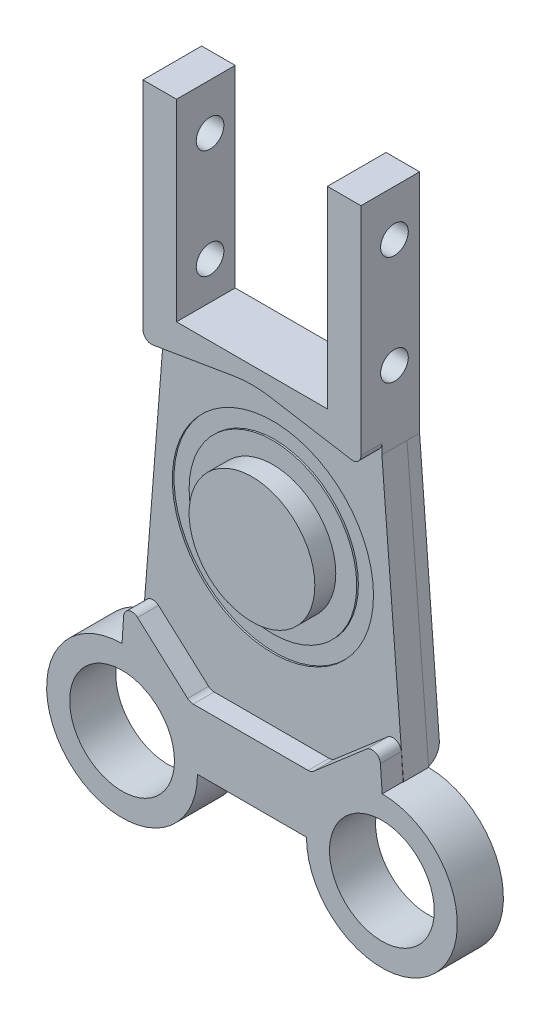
ISO-10303-21;
HEADER;
FILE_DESCRIPTION(('STEP AP214'),'2;1');
FILE_NAME('part.step','',(''),(''),'','','');
FILE_SCHEMA(('AUTOMOTIVE_DESIGN { 1 0 10303 214 1 1 1 1 }'));
ENDSEC;
DATA;
#1=APPLICATION_CONTEXT('core data for automotive mechanical design processes');
#2=APPLICATION_PROTOCOL_DEFINITION('international standard','automotive_design',2000,#1);
#3=PRODUCT_CONTEXT('',#1,'mechanical');
#4=PRODUCT('Part','Part','',(#3));
#5=PRODUCT_RELATED_PRODUCT_CATEGORY('part','',(#4));
#6=PRODUCT_DEFINITION_FORMATION('','',#4);
#7=PRODUCT_DEFINITION_CONTEXT('part definition',#1,'design');
#8=PRODUCT_DEFINITION('design','',#6,#7);
#9=PRODUCT_DEFINITION_SHAPE('','',#8);
#10=(LENGTH_UNIT() NAMED_UNIT(*) SI_UNIT(.MILLI.,.METRE.));
#11=(NAMED_UNIT(*) PLANE_ANGLE_UNIT() SI_UNIT($,.RADIAN.));
#12=(NAMED_UNIT(*) SI_UNIT($,.STERADIAN.) SOLID_ANGLE_UNIT());
#13=UNCERTAINTY_MEASURE_WITH_UNIT(LENGTH_MEASURE(1.E-05),#10,'distance_accuracy_value','');
#14=(GEOMETRIC_REPRESENTATION_CONTEXT(3) GLOBAL_UNCERTAINTY_ASSIGNED_CONTEXT((#13)) GLOBAL_UNIT_ASSIGNED_CONTEXT((#10,
#11,#12)) REPRESENTATION_CONTEXT('',''));
#15=CARTESIAN_POINT('',(0.,0.,0.));
#16=DIRECTION('',(0.,0.,1.));
#17=DIRECTION('',(1.,0.,0.));
#18=AXIS2_PLACEMENT_3D('',#15,#16,#17);
#19=CARTESIAN_POINT('',(15.5,-41.5,1.5));
#20=DIRECTION('',(0.,0.,1.));
#21=DIRECTION('',(1.,0.,0.));
#22=AXIS2_PLACEMENT_3D('',#19,#20,#21);
#23=CYLINDRICAL_SURFACE('',#22,9.);
#24=DIRECTION('',(0.,0.,1.));
#25=VECTOR('',#24,1.);
#26=CARTESIAN_POINT('',(15.5793928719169,-32.5003501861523,1.5));
#27=LINE('',#26,#25);
#28=CARTESIAN_POINT('',(15.5793928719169,-32.5003501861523,1.5));
#29=VERTEX_POINT('',#28);
#30=CARTESIAN_POINT('',(15.5793928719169,-32.5003501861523,4.5));
#31=VERTEX_POINT('',#30);
#32=EDGE_CURVE('E60',#29,#31,#27,.T.);
#33=ORIENTED_EDGE('',*,*,#32,.T.);
#34=CARTESIAN_POINT('',(15.5,-41.5,4.5));
#35=DIRECTION('',(0.,0.,-1.));
#36=DIRECTION('',(1.,0.,0.));
#37=AXIS2_PLACEMENT_3D('',#34,#35,#36);
#38=CIRCLE('',#37,9.);
#39=CARTESIAN_POINT('',(15.5396968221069,-32.5000875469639,4.5));
#40=VERTEX_POINT('',#39);
#41=EDGE_CURVE('E287',#40,#31,#38,.T.);
#42=ORIENTED_EDGE('',*,*,#41,.F.);
#43=DIRECTION('',(0.,0.,1.));
#44=VECTOR('',#43,1.);
#45=CARTESIAN_POINT('',(15.5396968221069,-32.5000875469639,2.));
#46=LINE('',#45,#44);
#47=CARTESIAN_POINT('',(15.5396968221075,-32.5000875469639,7.));
#48=VERTEX_POINT('',#47);
#49=EDGE_CURVE('E383',#40,#48,#46,.T.);
#50=ORIENTED_EDGE('',*,*,#49,.T.);
#51=CARTESIAN_POINT('',(15.5,-41.5,7.));
#52=DIRECTION('',(0.,0.,1.));
#53=DIRECTION('',(1.,0.,0.));
#54=AXIS2_PLACEMENT_3D('',#51,#52,#53);
#55=CIRCLE('',#54,9.);
#56=CARTESIAN_POINT('',(6.5,-41.5,7.));
#57=VERTEX_POINT('',#56);
#58=EDGE_CURVE('E434',#57,#48,#55,.T.);
#59=ORIENTED_EDGE('',*,*,#58,.F.);
#60=DIRECTION('',(0.,0.,1.));
#61=VECTOR('',#60,1.);
#62=CARTESIAN_POINT('',(6.5,-41.5,1.5));
#63=LINE('',#62,#61);
#64=CARTESIAN_POINT('',(6.5,-41.5,1.5));
#65=VERTEX_POINT('',#64);
#66=EDGE_CURVE('E443',#65,#57,#63,.T.);
#67=ORIENTED_EDGE('',*,*,#66,.F.);
#68=CARTESIAN_POINT('',(15.5,-41.5,1.5));
#69=DIRECTION('',(0.,0.,1.));
#70=DIRECTION('',(1.,0.,0.));
#71=AXIS2_PLACEMENT_3D('',#68,#69,#70);
#72=CIRCLE('',#71,9.);
#73=EDGE_CURVE('E433',#65,#29,#72,.T.);
#74=ORIENTED_EDGE('',*,*,#73,.T.);
#75=EDGE_LOOP('',(#33,#42,#50,#59,#67,#74));
#76=FACE_BOUND('',#75,.T.);
#77=ADVANCED_FACE('F43',(#76),#23,.T.);
#78=CARTESIAN_POINT('',(-15.5,-41.5,1.5));
#79=DIRECTION('',(0.,0.,1.));
#80=DIRECTION('',(1.,0.,0.));
#81=AXIS2_PLACEMENT_3D('',#78,#79,#80);
#82=CYLINDRICAL_SURFACE('',#81,9.);
#83=CARTESIAN_POINT('',(-15.5,-41.5,4.5));
#84=DIRECTION('',(0.,0.,-1.));
#85=DIRECTION('',(1.,0.,0.));
#86=AXIS2_PLACEMENT_3D('',#83,#84,#85);
#87=CIRCLE('',#86,9.);
#88=CARTESIAN_POINT('',(-15.5793928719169,-32.5003501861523,4.5));
#89=VERTEX_POINT('',#88);
#90=CARTESIAN_POINT('',(-15.5,-32.5,4.5));
#91=VERTEX_POINT('',#90);
#92=EDGE_CURVE('E739',#89,#91,#87,.T.);
#93=ORIENTED_EDGE('',*,*,#92,.F.);
#94=DIRECTION('',(0.,0.,1.));
#95=VECTOR('',#94,1.);
#96=CARTESIAN_POINT('',(-15.5793928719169,-32.5003501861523,1.5));
#97=LINE('',#96,#95);
#98=CARTESIAN_POINT('',(-15.5793928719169,-32.5003501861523,1.5));
#99=VERTEX_POINT('',#98);
#100=EDGE_CURVE('E68',#99,#89,#97,.T.);
#101=ORIENTED_EDGE('',*,*,#100,.F.);
#102=CARTESIAN_POINT('',(-15.5,-41.5,1.5));
#103=DIRECTION('',(0.,0.,1.));
#104=DIRECTION('',(1.,0.,0.));
#105=AXIS2_PLACEMENT_3D('',#102,#103,#104);
#106=CIRCLE('',#105,9.);
#107=CARTESIAN_POINT('',(-6.5,-41.5,1.5));
#108=VERTEX_POINT('',#107);
#109=EDGE_CURVE('E430',#99,#108,#106,.T.);
#110=ORIENTED_EDGE('',*,*,#109,.T.);
#111=DIRECTION('',(0.,0.,1.));
#112=VECTOR('',#111,1.);
#113=CARTESIAN_POINT('',(-6.5,-41.5,1.5));
#114=LINE('',#113,#112);
#115=CARTESIAN_POINT('',(-6.5,-41.5,7.));
#116=VERTEX_POINT('',#115);
#117=EDGE_CURVE('E445',#108,#116,#114,.T.);
#118=ORIENTED_EDGE('',*,*,#117,.T.);
#119=CARTESIAN_POINT('',(-15.5,-41.5,7.));
#120=DIRECTION('',(0.,0.,1.));
#121=DIRECTION('',(1.,0.,0.));
#122=AXIS2_PLACEMENT_3D('',#119,#120,#121);
#123=CIRCLE('',#122,9.);
#124=CARTESIAN_POINT('',(-15.5,-32.5,7.));
#125=VERTEX_POINT('',#124);
#126=EDGE_CURVE('E421',#125,#116,#123,.T.);
#127=ORIENTED_EDGE('',*,*,#126,.F.);
#128=DIRECTION('',(0.,0.,-1.));
#129=VECTOR('',#128,1.);
#130=CARTESIAN_POINT('',(-15.5,-32.5,7.));
#131=LINE('',#130,#129);
#132=EDGE_CURVE('E388',#125,#91,#131,.T.);
#133=ORIENTED_EDGE('',*,*,#132,.T.);
#134=EDGE_LOOP('',(#93,#101,#110,#118,#127,#133));
#135=FACE_BOUND('',#134,.T.);
#136=ADVANCED_FACE('F537',(#135),#82,.T.);
#137=CARTESIAN_POINT('',(-15.5,-41.5,1.5));
#138=DIRECTION('',(0.,0.,1.));
#139=DIRECTION('',(1.,0.,0.));
#140=AXIS2_PLACEMENT_3D('',#137,#138,#139);
#141=PLANE('',#140);
#142=CARTESIAN_POINT('',(-15.5,-41.5,1.5));
#143=DIRECTION('',(0.,0.,1.));
#144=DIRECTION('',(1.,0.,0.));
#145=AXIS2_PLACEMENT_3D('',#142,#143,#144);
#146=CIRCLE('',#145,6.25);
#147=CARTESIAN_POINT('',(-9.25,-41.5,1.5));
#148=VERTEX_POINT('',#147);
#149=EDGE_CURVE('E418',#148,#148,#146,.T.);
#150=ORIENTED_EDGE('',*,*,#149,.T.);
#151=EDGE_LOOP('',(#150));
#152=FACE_BOUND('',#151,.T.);
#153=CARTESIAN_POINT('',(-15.5,-41.5,1.5));
#154=DIRECTION('',(0.,0.,1.));
#155=DIRECTION('',(-1.,0.,0.));
#156=AXIS2_PLACEMENT_3D('',#153,#154,#155);
#157=CIRCLE('',#156,9.);
#158=CARTESIAN_POINT('',(-6.54540167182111,-40.5971330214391,1.5));
#159=VERTEX_POINT('',#158);
#160=EDGE_CURVE('E401',#159,#99,#157,.T.);
#161=ORIENTED_EDGE('',*,*,#160,.F.);
#162=CARTESIAN_POINT('',(-4.39920184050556,-41.5,1.02213938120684));
#163=CARTESIAN_POINT('',(-4.18680074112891,-41.5,0.0255685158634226));
#164=CARTESIAN_POINT('',(-4.19078849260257,-40.4812253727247,0.0442787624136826));
#165=CARTESIAN_POINT('',(-4.43368775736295,-41.5,1.01478622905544));
#166=CARTESIAN_POINT('',(-4.25670176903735,-41.5,0.0138106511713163));
#167=CARTESIAN_POINT('',(-4.25948797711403,-40.4842488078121,0.029572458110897));
#168=CARTESIAN_POINT('',(-4.46854493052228,-41.5,1.0092536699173));
#169=CARTESIAN_POINT('',(-4.32713276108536,-41.5,0.00580187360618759));
#170=CARTESIAN_POINT('',(-4.32892317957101,-40.4873332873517,0.0185073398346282));
#171=CARTESIAN_POINT('',(-4.53870324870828,-41.5,1.00185688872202));
#172=CARTESIAN_POINT('',(-4.46821920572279,-41.5,-0.00270969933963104));
#173=CARTESIAN_POINT('',(-4.46866984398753,-40.4936008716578,0.00371377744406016));
#174=CARTESIAN_POINT('',(-4.57400501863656,-41.5,0.999998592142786));
#175=CARTESIAN_POINT('',(-4.53886923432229,-41.5,-0.00322383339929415));
#176=CARTESIAN_POINT('',(-4.5389825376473,-40.4967841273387,-2.81571441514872E-06));
#177=CARTESIAN_POINT('',(-4.66595340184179,-41.5,1.00000225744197));
#178=CARTESIAN_POINT('',(-4.72182051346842,-41.5,0.00514770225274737));
#179=CARTESIAN_POINT('',(-4.7221105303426,-40.5051565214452,4.51488391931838E-06));
#180=CARTESIAN_POINT('',(-4.7226251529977,-41.5,1.0047859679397));
#181=CARTESIAN_POINT('',(-4.83380812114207,-41.5,0.0198253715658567));
#182=CARTESIAN_POINT('',(-4.83496912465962,-40.5103969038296,0.00957193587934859));
#183=CARTESIAN_POINT('',(-4.83437423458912,-41.5,1.023796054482));
#184=CARTESIAN_POINT('',(-5.05291632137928,-41.5,0.0675814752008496));
#185=CARTESIAN_POINT('',(-5.05748845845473,-40.5208914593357,0.0475921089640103));
#186=CARTESIAN_POINT('',(-4.88945061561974,-41.5,1.03802793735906));
#187=CARTESIAN_POINT('',(-5.1600629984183,-41.5,0.100576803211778));
#188=CARTESIAN_POINT('',(-5.16714729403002,-40.5261456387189,0.0760558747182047));
#189=CARTESIAN_POINT('',(-4.99637973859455,-41.5,1.07551964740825));
#190=CARTESIAN_POINT('',(-5.36650551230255,-41.5,0.183603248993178));
#191=CARTESIAN_POINT('',(-5.38002485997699,-40.536498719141,0.151039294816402));
#192=CARTESIAN_POINT('',(-5.04823586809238,-41.5,1.09876979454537));
#193=CARTESIAN_POINT('',(-5.46586645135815,-41.5,0.233538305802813));
#194=CARTESIAN_POINT('',(-5.48325035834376,-40.5415977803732,0.197539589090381));
#195=CARTESIAN_POINT('',(-5.14738815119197,-41.5,1.15369915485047));
#196=CARTESIAN_POINT('',(-5.65448591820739,-41.5,0.348840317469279));
#197=CARTESIAN_POINT('',(-5.68060474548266,-40.5514817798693,0.307398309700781));
#198=CARTESIAN_POINT('',(-5.19467644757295,-41.5,1.18539255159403));
#199=CARTESIAN_POINT('',(-5.74380843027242,-41.5,0.414181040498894));
#200=CARTESIAN_POINT('',(-5.7747179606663,-40.556266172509,0.370785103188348));
#201=CARTESIAN_POINT('',(-5.28316262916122,-41.5,1.25624474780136));
#202=CARTESIAN_POINT('',(-5.90985402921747,-41.5,0.558099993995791));
#203=CARTESIAN_POINT('',(-5.95080721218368,-40.5653278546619,0.512489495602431));
#204=CARTESIAN_POINT('',(-5.32436996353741,-41.5,1.29539174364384));
#205=CARTESIAN_POINT('',(-5.98669012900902,-41.5,0.636635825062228));
#206=CARTESIAN_POINT('',(-6.03280207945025,-40.5696059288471,0.59078348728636));
#207=CARTESIAN_POINT('',(-5.39952285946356,-41.5,1.38000730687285));
#208=CARTESIAN_POINT('',(-6.12602467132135,-41.5,0.804599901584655));
#209=CARTESIAN_POINT('',(-6.18233046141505,-40.5774873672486,0.760014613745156));
#210=CARTESIAN_POINT('',(-5.43348075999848,-41.5,1.42546491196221));
#211=CARTESIAN_POINT('',(-6.18864334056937,-41.5,0.894022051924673));
#212=CARTESIAN_POINT('',(-6.24988854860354,-40.5810918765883,0.850929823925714));
#213=CARTESIAN_POINT('',(-5.49312506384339,-41.5,1.52129384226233));
#214=CARTESIAN_POINT('',(-6.29811908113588,-41.5,1.08108938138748));
#215=CARTESIAN_POINT('',(-6.36854148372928,-40.5874719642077,1.04258768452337));
#216=CARTESIAN_POINT('',(-5.51884018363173,-41.5,1.57164729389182));
#217=CARTESIAN_POINT('',(-6.34511727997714,-41.5,1.17874964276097));
#218=CARTESIAN_POINT('',(-6.41969348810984,-40.5902504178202,1.14329458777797));
#219=CARTESIAN_POINT('',(-5.56141580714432,-41.5,1.67598039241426));
#220=CARTESIAN_POINT('',(-6.42266562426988,-41.5,1.38003406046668));
#221=CARTESIAN_POINT('',(-6.50438048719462,-40.5948742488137,1.35196078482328));
#222=CARTESIAN_POINT('',(-5.57827483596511,-41.5,1.72996064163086));
#223=CARTESIAN_POINT('',(-6.45328113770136,-41.5,1.48373319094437));
#224=CARTESIAN_POINT('',(-6.53791254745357,-40.5967194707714,1.45992128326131));
#225=CARTESIAN_POINT('',(-5.60255543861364,-41.5,1.8397155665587));
#226=CARTESIAN_POINT('',(-6.4972831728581,-41.5,1.69391772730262));
#227=CARTESIAN_POINT('',(-6.58620506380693,-40.5993823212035,1.67943113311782));
#228=CARTESIAN_POINT('',(-5.61002422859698,-41.5,1.89547980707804));
#229=CARTESIAN_POINT('',(-6.51079657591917,-41.5,1.80047860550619));
#230=CARTESIAN_POINT('',(-6.60105943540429,-40.6002050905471,1.79095961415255));
#231=CARTESIAN_POINT('',(-5.61552180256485,-41.5,2.00751495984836));
#232=CARTESIAN_POINT('',(-6.52073680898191,-41.5,2.01434086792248));
#233=CARTESIAN_POINT('',(-6.61199306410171,-40.6008124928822,2.01502991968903));
#234=CARTESIAN_POINT('',(-5.61354289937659,-41.5,2.06378624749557));
#235=CARTESIAN_POINT('',(-6.51715914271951,-41.5,2.12174373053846));
#236=CARTESIAN_POINT('',(-6.6080570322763,-40.6005962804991,2.12757249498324));
#237=CARTESIAN_POINT('',(-5.60675465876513,-41.5,2.11949141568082));
#238=CARTESIAN_POINT('',(-6.50488203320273,-41.5,2.22813517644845));
#239=CARTESIAN_POINT('',(-6.59455654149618,-40.5998460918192,2.23898283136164));
#240=(BOUNDED_SURFACE() B_SPLINE_SURFACE(3,2,((#162,#163,#164),(#165,#166,#167),(#168,#169,
#170),(#171,#172,#173),(#174,#175,#176),(#177,#178,#179),(#180,#181,#182),(#183,#184,#185),
(#186,#187,#188),(#189,#190,#191),(#192,#193,#194),(#195,#196,#197),(#198,#199,#200),(#201,#202,
#203),(#204,#205,#206),(#207,#208,#209),(#210,#211,#212),(#213,#214,#215),(#216,#217,#218),
(#219,#220,#221),(#222,#223,#224),(#225,#226,#227),(#228,#229,#230),(#231,#232,#233),(#234,#235,
#236),(#237,#238,#239)),.UNSPECIFIED.,.F.,.F.,.F.) B_SPLINE_SURFACE_WITH_KNOTS((4,2,2,2,2,2,2,2,
2,2,2,2,4),(3,3),(0.,0.105702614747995,0.211575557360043,0.381338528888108,0.551200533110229,
0.720880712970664,0.890847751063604,1.06054783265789,1.22995672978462,1.39876885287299,
1.5676090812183,1.73559690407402,1.90372143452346),(0.,1.),
.UNSPECIFIED.) GEOMETRIC_REPRESENTATION_ITEM() RATIONAL_B_SPLINE_SURFACE(((1.,0.70043749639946,
1.),(1.,0.701516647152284,1.),(1.,0.70261503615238,1.),(1.,0.704841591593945,1.),(1.,
0.705969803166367,1.),(1.,0.708929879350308,1.),(1.,0.710775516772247,1.),(1.,0.714457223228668,
1.),(1.,0.716293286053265,1.),(1.,0.719897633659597,1.),(1.,0.721665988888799,1.),(1.,
0.725081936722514,1.),(1.,0.726729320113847,1.),(1.,0.729839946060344,1.),(1.,0.731303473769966,
1.),(1.,0.733992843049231,1.),(1.,0.735219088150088,1.),(1.,0.737385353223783,1.),(1.,
0.738326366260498,1.),(1.,0.739890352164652,1.),(1.,0.740513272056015,1.),(1.,0.741411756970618,
1.),(1.,0.741689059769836,1.),(1.,0.741893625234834,1.),(1.,0.741820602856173,1.),(1.,
0.741567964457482,1.))) REPRESENTATION_ITEM('') SURFACE());
#241=CARTESIAN_POINT('',(-6.54540167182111,-40.5971330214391,1.5));
#242=CARTESIAN_POINT('',(-6.54264626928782,-40.6244644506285,1.5));
#243=CARTESIAN_POINT('',(-6.53872843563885,-40.651665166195,1.5));
#244=CARTESIAN_POINT('',(-6.52860155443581,-40.7056338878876,1.5));
#245=CARTESIAN_POINT('',(-6.52239273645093,-40.7324019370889,1.5));
#246=CARTESIAN_POINT('',(-6.50041595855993,-40.8116754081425,1.5));
#247=CARTESIAN_POINT('',(-6.48128346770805,-40.8632891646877,1.5));
#248=CARTESIAN_POINT('',(-6.43464695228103,-40.962561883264,1.5));
#249=CARTESIAN_POINT('',(-6.40714106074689,-41.0102199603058,1.5));
#250=CARTESIAN_POINT('',(-6.34459633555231,-41.100319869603,1.5));
#251=CARTESIAN_POINT('',(-6.30955613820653,-41.142760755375,1.5));
#252=CARTESIAN_POINT('',(-6.23256678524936,-41.2217752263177,1.5));
#253=CARTESIAN_POINT('',(-6.19054324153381,-41.258276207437,1.5));
#254=CARTESIAN_POINT('',(-6.10115786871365,-41.3239549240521,1.5));
#255=CARTESIAN_POINT('',(-6.05379813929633,-41.3531355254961,1.5));
#256=CARTESIAN_POINT('',(-5.95341461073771,-41.4045138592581,1.5));
#257=CARTESIAN_POINT('',(-5.90025343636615,-41.4264421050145,1.5));
#258=CARTESIAN_POINT('',(-5.79106867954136,-41.4617529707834,1.5));
#259=CARTESIAN_POINT('',(-5.73504019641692,-41.4751203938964,1.5));
#260=CARTESIAN_POINT('',(-5.64790435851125,-41.4892540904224,1.5));
#261=CARTESIAN_POINT('',(-5.61724016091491,-41.4929888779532,1.5));
#262=CARTESIAN_POINT('',(-5.55570242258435,-41.4981520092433,1.5));
#263=CARTESIAN_POINT('',(-5.52482880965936,-41.4995795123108,1.5));
#264=CARTESIAN_POINT('',(-5.46318329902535,-41.500258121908,1.5));
#265=CARTESIAN_POINT('',(-5.43241146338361,-41.499517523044,1.5));
#266=CARTESIAN_POINT('',(-5.37100599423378,-41.4960812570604,1.5));
#267=CARTESIAN_POINT('',(-5.3403722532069,-41.4933875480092,1.5));
#268=CARTESIAN_POINT('',(-5.30985374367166,-41.4898179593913,1.5));
#269=B_SPLINE_CURVE_WITH_KNOTS('',3,(#241,#242,#243,#244,#245,#246,#247,#248,#249,#250,#251,
#252,#253,#254,#255,#256,#257,#258,#259,#260,#261,#262,#263,#264,#265,#266,#267,#268),
.UNSPECIFIED.,.F.,.F.,(4,2,2,2,2,2,2,2,2,2,2,2,2,4),(0.,0.0823584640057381,0.164708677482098,
0.328995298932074,0.493318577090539,0.657671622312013,0.823903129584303,0.990069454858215,
1.16185458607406,1.33394382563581,1.42654210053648,1.51917410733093,1.61145219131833,
1.70363789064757),.UNSPECIFIED.);
#270=CARTESIAN_POINT('',(-5.47930686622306,-41.5,1.5));
#271=VERTEX_POINT('',#270);
#272=EDGE_CURVE('E11',#159,#271,#269,.T.);
#273=ORIENTED_EDGE('',*,*,#272,.T.);
#274=DIRECTION('',(1.,0.,0.));
#275=VECTOR('',#274,1.);
#276=CARTESIAN_POINT('',(-15.5,-41.5,1.5));
#277=LINE('',#276,#275);
#278=EDGE_CURVE('E720',#108,#271,#277,.T.);
#279=ORIENTED_EDGE('',*,*,#278,.F.);
#280=ORIENTED_EDGE('',*,*,#109,.F.);
#281=EDGE_LOOP('',(#161,#273,#279,#280));
#282=FACE_BOUND('',#281,.T.);
#283=ADVANCED_FACE('F532',(#152,#282),#141,.F.);
#284=CARTESIAN_POINT('',(15.5,-41.5,1.5));
#285=DIRECTION('',(0.,0.,1.));
#286=DIRECTION('',(1.,0.,0.));
#287=AXIS2_PLACEMENT_3D('',#284,#285,#286);
#288=CIRCLE('',#287,6.25);
#289=CARTESIAN_POINT('',(21.75,-41.5,1.5));
#290=VERTEX_POINT('',#289);
#291=EDGE_CURVE('E416',#290,#290,#288,.T.);
#292=ORIENTED_EDGE('',*,*,#291,.T.);
#293=EDGE_LOOP('',(#292));
#294=FACE_BOUND('',#293,.T.);
#295=CARTESIAN_POINT('',(15.5,-41.5,1.5));
#296=DIRECTION('',(0.,0.,1.));
#297=DIRECTION('',(-1.,0.,0.));
#298=AXIS2_PLACEMENT_3D('',#295,#296,#297);
#299=CIRCLE('',#298,9.);
#300=CARTESIAN_POINT('',(15.5,-32.5,1.5));
#301=VERTEX_POINT('',#300);
#302=CARTESIAN_POINT('',(6.54540167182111,-40.5971330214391,1.5));
#303=VERTEX_POINT('',#302);
#304=EDGE_CURVE('E391',#301,#303,#299,.T.);
#305=ORIENTED_EDGE('',*,*,#304,.F.);
#306=DIRECTION('',(0.0766964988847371,-0.997054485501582,0.));
#307=VECTOR('',#306,1.);
#308=CARTESIAN_POINT('',(15.5,-32.5,1.5));
#309=LINE('',#308,#307);
#310=CARTESIAN_POINT('',(13.,0.,1.5));
#311=VERTEX_POINT('',#310);
#312=EDGE_CURVE('E395',#311,#301,#309,.T.);
#313=ORIENTED_EDGE('',*,*,#312,.F.);
#314=DIRECTION('',(-0.0791163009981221,0.996865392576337,0.));
#315=VECTOR('',#314,1.);
#316=CARTESIAN_POINT('',(15.5793928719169,-32.5003501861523,1.5));
#317=LINE('',#316,#315);
#318=EDGE_CURVE('E273',#29,#311,#317,.T.);
#319=ORIENTED_EDGE('',*,*,#318,.F.);
#320=ORIENTED_EDGE('',*,*,#73,.F.);
#321=DIRECTION('',(1.,0.,0.));
#322=VECTOR('',#321,1.);
#323=CARTESIAN_POINT('',(-15.5,-41.5,1.5));
#324=LINE('',#323,#322);
#325=CARTESIAN_POINT('',(5.47930686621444,-41.5,1.5));
#326=VERTEX_POINT('',#325);
#327=EDGE_CURVE('E711',#326,#65,#324,.T.);
#328=ORIENTED_EDGE('',*,*,#327,.F.);
#329=CARTESIAN_POINT('',(4.19078849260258,-40.4812253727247,0.0442787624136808));
#330=CARTESIAN_POINT('',(4.18680074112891,-41.5,0.0255685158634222));
#331=CARTESIAN_POINT('',(4.39920184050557,-41.5,1.02213938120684));
#332=CARTESIAN_POINT('',(4.25948797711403,-40.4842488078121,0.0295724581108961));
#333=CARTESIAN_POINT('',(4.25670176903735,-41.5,0.0138106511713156));
#334=CARTESIAN_POINT('',(4.43368775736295,-41.5,1.01478622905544));
#335=CARTESIAN_POINT('',(4.32892317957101,-40.4873332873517,0.0185073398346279));
#336=CARTESIAN_POINT('',(4.32713276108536,-41.5,0.00580187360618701));
#337=CARTESIAN_POINT('',(4.46854493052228,-41.5,1.0092536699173));
#338=CARTESIAN_POINT('',(4.46866984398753,-40.4936008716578,0.00371377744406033));
#339=CARTESIAN_POINT('',(4.46821920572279,-41.5,-0.00270969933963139));
#340=CARTESIAN_POINT('',(4.53870324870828,-41.5,1.00185688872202));
#341=CARTESIAN_POINT('',(4.53898253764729,-40.4967841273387,-2.81571441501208E-06));
#342=CARTESIAN_POINT('',(4.53886923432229,-41.5,-0.00322383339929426));
#343=CARTESIAN_POINT('',(4.57400501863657,-41.5,0.999998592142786));
#344=CARTESIAN_POINT('',(4.7221105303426,-40.5051565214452,4.51488391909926E-06));
#345=CARTESIAN_POINT('',(4.72182051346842,-41.5,0.00514770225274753));
#346=CARTESIAN_POINT('',(4.66595340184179,-41.5,1.00000225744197));
#347=CARTESIAN_POINT('',(4.83496912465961,-40.5103969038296,0.00957193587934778));
#348=CARTESIAN_POINT('',(4.83380812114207,-41.5,0.0198253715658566));
#349=CARTESIAN_POINT('',(4.72262515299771,-41.5,1.0047859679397));
#350=CARTESIAN_POINT('',(5.05748845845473,-40.5208914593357,0.0475921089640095));
#351=CARTESIAN_POINT('',(5.05291632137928,-41.5,0.0675814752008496));
#352=CARTESIAN_POINT('',(4.83437423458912,-41.5,1.023796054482));
#353=CARTESIAN_POINT('',(5.16714729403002,-40.5261456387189,0.0760558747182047));
#354=CARTESIAN_POINT('',(5.1600629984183,-41.5,0.100576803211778));
#355=CARTESIAN_POINT('',(4.88945061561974,-41.5,1.03802793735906));
#356=CARTESIAN_POINT('',(5.38002485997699,-40.536498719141,0.151039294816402));
#357=CARTESIAN_POINT('',(5.36650551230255,-41.5,0.183603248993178));
#358=CARTESIAN_POINT('',(4.99637973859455,-41.5,1.07551964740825));
#359=CARTESIAN_POINT('',(5.48325035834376,-40.5415977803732,0.19753958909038));
#360=CARTESIAN_POINT('',(5.46586645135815,-41.5,0.233538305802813));
#361=CARTESIAN_POINT('',(5.04823586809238,-41.5,1.09876979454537));
#362=CARTESIAN_POINT('',(5.68060474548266,-40.5514817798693,0.307398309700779));
#363=CARTESIAN_POINT('',(5.65448591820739,-41.5,0.348840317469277));
#364=CARTESIAN_POINT('',(5.14738815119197,-41.5,1.15369915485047));
#365=CARTESIAN_POINT('',(5.7747179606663,-40.556266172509,0.370785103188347));
#366=CARTESIAN_POINT('',(5.74380843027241,-41.5,0.414181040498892));
#367=CARTESIAN_POINT('',(5.19467644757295,-41.5,1.18539255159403));
#368=CARTESIAN_POINT('',(5.95080721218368,-40.5653278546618,0.512489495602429));
#369=CARTESIAN_POINT('',(5.90985402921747,-41.5,0.558099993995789));
#370=CARTESIAN_POINT('',(5.28316262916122,-41.5,1.25624474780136));
#371=CARTESIAN_POINT('',(6.03280207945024,-40.5696059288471,0.590783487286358));
#372=CARTESIAN_POINT('',(5.98669012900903,-41.5,0.636635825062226));
#373=CARTESIAN_POINT('',(5.32436996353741,-41.5,1.29539174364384));
#374=CARTESIAN_POINT('',(6.18233046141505,-40.5774873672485,0.760014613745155));
#375=CARTESIAN_POINT('',(6.12602467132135,-41.5,0.804599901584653));
#376=CARTESIAN_POINT('',(5.39952285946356,-41.5,1.38000730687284));
#377=CARTESIAN_POINT('',(6.24988854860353,-40.5810918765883,0.850929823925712));
#378=CARTESIAN_POINT('',(6.18864334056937,-41.5,0.894022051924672));
#379=CARTESIAN_POINT('',(5.43348075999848,-41.5,1.42546491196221));
#380=CARTESIAN_POINT('',(6.36854148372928,-40.5874719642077,1.04258768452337));
#381=CARTESIAN_POINT('',(6.29811908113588,-41.5,1.08108938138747));
#382=CARTESIAN_POINT('',(5.49312506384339,-41.5,1.52129384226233));
#383=CARTESIAN_POINT('',(6.41969348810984,-40.5902504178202,1.14329458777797));
#384=CARTESIAN_POINT('',(6.34511727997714,-41.5,1.17874964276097));
#385=CARTESIAN_POINT('',(5.51884018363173,-41.5,1.57164729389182));
#386=CARTESIAN_POINT('',(6.50438048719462,-40.5948742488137,1.35196078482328));
#387=CARTESIAN_POINT('',(6.42266562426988,-41.5,1.38003406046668));
#388=CARTESIAN_POINT('',(5.56141580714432,-41.5,1.67598039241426));
#389=CARTESIAN_POINT('',(6.53791254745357,-40.5967194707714,1.45992128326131));
#390=CARTESIAN_POINT('',(6.45328113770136,-41.5,1.48373319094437));
#391=CARTESIAN_POINT('',(5.57827483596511,-41.5,1.72996064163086));
#392=CARTESIAN_POINT('',(6.58620506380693,-40.5993823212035,1.67943113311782));
#393=CARTESIAN_POINT('',(6.4972831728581,-41.5,1.69391772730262));
#394=CARTESIAN_POINT('',(5.60255543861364,-41.5,1.8397155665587));
#395=CARTESIAN_POINT('',(6.60105943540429,-40.6002050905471,1.79095961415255));
#396=CARTESIAN_POINT('',(6.51079657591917,-41.5,1.80047860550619));
#397=CARTESIAN_POINT('',(5.61002422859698,-41.5,1.89547980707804));
#398=CARTESIAN_POINT('',(6.61199306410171,-40.6008124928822,2.01502991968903));
#399=CARTESIAN_POINT('',(6.52073680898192,-41.5,2.01434086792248));
#400=CARTESIAN_POINT('',(5.61552180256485,-41.5,2.00751495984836));
#401=CARTESIAN_POINT('',(6.6080570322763,-40.600596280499,2.12757249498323));
#402=CARTESIAN_POINT('',(6.51715914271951,-41.5,2.12174373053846));
#403=CARTESIAN_POINT('',(5.61354289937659,-41.5,2.06378624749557));
#404=CARTESIAN_POINT('',(6.59455654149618,-40.5998460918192,2.23898283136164));
#405=CARTESIAN_POINT('',(6.50488203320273,-41.5,2.22813517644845));
#406=CARTESIAN_POINT('',(5.60675465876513,-41.5,2.11949141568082));
#407=(BOUNDED_SURFACE() B_SPLINE_SURFACE(3,2,((#329,#330,#331),(#332,#333,#334),(#335,#336,
#337),(#338,#339,#340),(#341,#342,#343),(#344,#345,#346),(#347,#348,#349),(#350,#351,#352),
(#353,#354,#355),(#356,#357,#358),(#359,#360,#361),(#362,#363,#364),(#365,#366,#367),(#368,#369,
#370),(#371,#372,#373),(#374,#375,#376),(#377,#378,#379),(#380,#381,#382),(#383,#384,#385),
(#386,#387,#388),(#389,#390,#391),(#392,#393,#394),(#395,#396,#397),(#398,#399,#400),(#401,#402,
#403),(#404,#405,#406)),.UNSPECIFIED.,.F.,.F.,.F.) B_SPLINE_SURFACE_WITH_KNOTS((4,2,2,2,2,2,2,2,
2,2,2,2,4),(3,3),(0.,0.105702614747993,0.211575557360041,0.381338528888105,0.551200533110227,
0.720880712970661,0.890847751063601,1.06054783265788,1.22995672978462,1.39876885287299,
1.5676090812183,1.73559690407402,1.90372143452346),(0.,1.),
.UNSPECIFIED.) GEOMETRIC_REPRESENTATION_ITEM() RATIONAL_B_SPLINE_SURFACE(((1.,0.70043749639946,
1.),(1.,0.701516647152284,1.),(1.,0.70261503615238,1.),(1.,0.704841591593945,1.),(1.,
0.705969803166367,1.),(1.,0.708929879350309,1.),(1.,0.710775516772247,1.),(1.,0.714457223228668,
1.),(1.,0.716293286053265,1.),(1.,0.719897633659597,1.),(1.,0.721665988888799,1.),(1.,
0.725081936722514,1.),(1.,0.726729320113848,1.),(1.,0.729839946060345,1.),(1.,0.731303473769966,
1.),(1.,0.733992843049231,1.),(1.,0.735219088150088,1.),(1.,0.737385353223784,1.),(1.,
0.738326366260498,1.),(1.,0.739890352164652,1.),(1.,0.740513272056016,1.),(1.,0.741411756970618,
1.),(1.,0.741689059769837,1.),(1.,0.741893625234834,1.),(1.,0.741820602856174,1.),(1.,
0.741567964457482,1.))) REPRESENTATION_ITEM('') SURFACE());
#408=CARTESIAN_POINT('',(6.54540167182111,-40.5971330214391,1.5));
#409=CARTESIAN_POINT('',(6.54264626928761,-40.6244644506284,1.5));
#410=CARTESIAN_POINT('',(6.53872843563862,-40.6516651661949,1.5));
#411=CARTESIAN_POINT('',(6.52860155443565,-40.7056338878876,1.5));
#412=CARTESIAN_POINT('',(6.52239273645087,-40.7324019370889,1.5));
#413=CARTESIAN_POINT('',(6.50041595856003,-40.8116754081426,1.5));
#414=CARTESIAN_POINT('',(6.48128346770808,-40.8632891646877,1.5));
#415=CARTESIAN_POINT('',(6.43464695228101,-40.9625618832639,1.5));
#416=CARTESIAN_POINT('',(6.40714106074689,-41.0102199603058,1.5));
#417=CARTESIAN_POINT('',(6.34459633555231,-41.100319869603,1.5));
#418=CARTESIAN_POINT('',(6.30955613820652,-41.142760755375,1.5));
#419=CARTESIAN_POINT('',(6.23256678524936,-41.2217752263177,1.5));
#420=CARTESIAN_POINT('',(6.19054324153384,-41.2582762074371,1.5));
#421=CARTESIAN_POINT('',(6.10115786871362,-41.3239549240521,1.5));
#422=CARTESIAN_POINT('',(6.05379813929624,-41.3531355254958,1.5));
#423=CARTESIAN_POINT('',(5.95341461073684,-41.4045138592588,1.5));
#424=CARTESIAN_POINT('',(5.90025343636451,-41.4264421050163,1.5));
#425=CARTESIAN_POINT('',(5.79106867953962,-41.4617529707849,1.5));
#426=CARTESIAN_POINT('',(5.73504019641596,-41.4751203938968,1.5));
#427=CARTESIAN_POINT('',(5.64790435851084,-41.4892540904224,1.5));
#428=CARTESIAN_POINT('',(5.61724016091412,-41.4929888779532,1.5));
#429=CARTESIAN_POINT('',(5.55570242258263,-41.4981520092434,1.5));
#430=CARTESIAN_POINT('',(5.52482880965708,-41.4995795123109,1.5));
#431=CARTESIAN_POINT('',(5.46318329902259,-41.500258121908,1.5));
#432=CARTESIAN_POINT('',(5.43241146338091,-41.4995175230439,1.5));
#433=CARTESIAN_POINT('',(5.37100599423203,-41.4960812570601,1.5));
#434=CARTESIAN_POINT('',(5.34037225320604,-41.493387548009,1.5));
#435=CARTESIAN_POINT('',(5.30985374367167,-41.4898179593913,1.5));
#436=B_SPLINE_CURVE_WITH_KNOTS('',3,(#408,#409,#410,#411,#412,#413,#414,#415,#416,#417,#418,
#419,#420,#421,#422,#423,#424,#425,#426,#427,#428,#429,#430,#431,#432,#433,#434,#435),
.UNSPECIFIED.,.F.,.F.,(4,2,2,2,2,2,2,2,2,2,2,2,2,4),(0.,0.0823584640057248,0.164708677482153,
0.328995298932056,0.493318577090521,0.657671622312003,0.823903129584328,0.990069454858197,
1.1618545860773,1.33394382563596,1.42654210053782,1.5191741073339,1.61145219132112,
1.70363789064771),.UNSPECIFIED.);
#437=EDGE_CURVE('E52',#326,#303,#436,.F.);
#438=ORIENTED_EDGE('',*,*,#437,.T.);
#439=EDGE_LOOP('',(#305,#313,#319,#320,#328,#438));
#440=FACE_BOUND('',#439,.T.);
#441=ADVANCED_FACE('F536',(#294,#440),#141,.F.);
#442=CARTESIAN_POINT('',(0.,0.,7.));
#443=DIRECTION('',(0.,0.,1.));
#444=DIRECTION('',(1.,0.,0.));
#445=AXIS2_PLACEMENT_3D('',#442,#443,#444);
#446=PLANE('',#445);
#447=DIRECTION('',(-0.986206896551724,0.16551724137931,0.));
#448=VECTOR('',#447,1.);
#449=CARTESIAN_POINT('',(13.,0.,7.));
#450=LINE('',#449,#448);
#451=CARTESIAN_POINT('',(11.8344827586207,0.195611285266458,7.));
#452=VERTEX_POINT('',#451);
#453=CARTESIAN_POINT('',(2.15172413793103,1.82068965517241,7.));
#454=VERTEX_POINT('',#453);
#455=EDGE_CURVE('E398',#452,#454,#450,.T.);
#456=ORIENTED_EDGE('',*,*,#455,.F.);
#457=CARTESIAN_POINT('',(12.,1.18181818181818,7.));
#458=DIRECTION('',(0.,0.,1.));
#459=DIRECTION('',(1.,0.,0.));
#460=AXIS2_PLACEMENT_3D('',#457,#458,#459);
#461=CIRCLE('',#460,1.);
#462=CARTESIAN_POINT('',(13.,1.18181818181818,7.));
#463=VERTEX_POINT('',#462);
#464=EDGE_CURVE('E653',#452,#463,#461,.T.);
#465=ORIENTED_EDGE('',*,*,#464,.T.);
#466=DIRECTION('',(0.,1.,0.));
#467=VECTOR('',#466,1.);
#468=CARTESIAN_POINT('',(13.,0.,7.));
#469=LINE('',#468,#467);
#470=CARTESIAN_POINT('',(13.,27.,7.));
#471=VERTEX_POINT('',#470);
#472=EDGE_CURVE('E452',#463,#471,#469,.T.);
#473=ORIENTED_EDGE('',*,*,#472,.T.);
#474=DIRECTION('',(1.,0.,0.));
#475=VECTOR('',#474,1.);
#476=CARTESIAN_POINT('',(9.,27.,7.));
#477=LINE('',#476,#475);
#478=CARTESIAN_POINT('',(9.,27.,7.));
#479=VERTEX_POINT('',#478);
#480=EDGE_CURVE('E327',#479,#471,#477,.T.);
#481=ORIENTED_EDGE('',*,*,#480,.F.);
#482=DIRECTION('',(0.,-1.,0.));
#483=VECTOR('',#482,1.);
#484=CARTESIAN_POINT('',(9.,24.,7.));
#485=LINE('',#484,#483);
#486=CARTESIAN_POINT('',(9.,4.,7.));
#487=VERTEX_POINT('',#486);
#488=EDGE_CURVE('E454',#479,#487,#485,.T.);
#489=ORIENTED_EDGE('',*,*,#488,.T.);
#490=DIRECTION('',(-1.,0.,0.));
#491=VECTOR('',#490,1.);
#492=CARTESIAN_POINT('',(9.,4.,7.));
#493=LINE('',#492,#491);
#494=CARTESIAN_POINT('',(-9.,4.,7.));
#495=VERTEX_POINT('',#494);
#496=EDGE_CURVE('E457',#487,#495,#493,.T.);
#497=ORIENTED_EDGE('',*,*,#496,.T.);
#498=DIRECTION('',(0.,1.,0.));
#499=VECTOR('',#498,1.);
#500=CARTESIAN_POINT('',(-9.,4.,7.));
#501=LINE('',#500,#499);
#502=CARTESIAN_POINT('',(-9.,27.,7.));
#503=VERTEX_POINT('',#502);
#504=EDGE_CURVE('E442',#495,#503,#501,.T.);
#505=ORIENTED_EDGE('',*,*,#504,.T.);
#506=DIRECTION('',(1.,0.,0.));
#507=VECTOR('',#506,1.);
#508=CARTESIAN_POINT('',(-13.,27.,7.));
#509=LINE('',#508,#507);
#510=CARTESIAN_POINT('',(-13.,27.,7.));
#511=VERTEX_POINT('',#510);
#512=EDGE_CURVE('E336',#511,#503,#509,.T.);
#513=ORIENTED_EDGE('',*,*,#512,.F.);
#514=DIRECTION('',(0.,-1.,0.));
#515=VECTOR('',#514,1.);
#516=CARTESIAN_POINT('',(-13.,24.,7.));
#517=LINE('',#516,#515);
#518=CARTESIAN_POINT('',(-13.,1.18181818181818,7.));
#519=VERTEX_POINT('',#518);
#520=EDGE_CURVE('E449',#511,#519,#517,.T.);
#521=ORIENTED_EDGE('',*,*,#520,.T.);
#522=CARTESIAN_POINT('',(-12.,1.18181818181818,7.));
#523=DIRECTION('',(0.,0.,1.));
#524=DIRECTION('',(1.,0.,0.));
#525=AXIS2_PLACEMENT_3D('',#522,#523,#524);
#526=CIRCLE('',#525,1.);
#527=CARTESIAN_POINT('',(-11.8344827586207,0.195611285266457,7.));
#528=VERTEX_POINT('',#527);
#529=EDGE_CURVE('E657',#519,#528,#526,.T.);
#530=ORIENTED_EDGE('',*,*,#529,.T.);
#531=DIRECTION('',(-0.986206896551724,-0.16551724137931,0.));
#532=VECTOR('',#531,1.);
#533=CARTESIAN_POINT('',(-13.,0.,7.));
#534=LINE('',#533,#532);
#535=CARTESIAN_POINT('',(-2.15172413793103,1.82068965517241,7.));
#536=VERTEX_POINT('',#535);
#537=EDGE_CURVE('E410',#536,#528,#534,.T.);
#538=ORIENTED_EDGE('',*,*,#537,.F.);
#539=CARTESIAN_POINT('',(0.,-11.,7.));
#540=DIRECTION('',(0.,0.,1.));
#541=DIRECTION('',(1.,0.,0.));
#542=AXIS2_PLACEMENT_3D('',#539,#540,#541);
#543=CIRCLE('',#542,13.);
#544=EDGE_CURVE('E407',#454,#536,#543,.T.);
#545=ORIENTED_EDGE('',*,*,#544,.F.);
#546=EDGE_LOOP('',(#456,#465,#473,#481,#489,#497,#505,#513,#521,#530,#538,#545));
#547=FACE_BOUND('',#546,.T.);
#548=ADVANCED_FACE('F614',(#547),#446,.T.);
#549=DIRECTION('',(-0.071248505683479,0.997458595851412,0.));
#550=VECTOR('',#549,1.);
#551=CARTESIAN_POINT('',(15.5396968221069,-32.5000875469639,7.));
#552=LINE('',#551,#550);
#553=CARTESIAN_POINT('',(15.3245821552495,-29.4885440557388,7.));
#554=VERTEX_POINT('',#553);
#555=EDGE_CURVE('E368',#48,#554,#552,.T.);
#556=ORIENTED_EDGE('',*,*,#555,.T.);
#557=CARTESIAN_POINT('',(14.3271235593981,-29.5597925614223,7.));
#558=DIRECTION('',(0.,0.,1.));
#559=DIRECTION('',(1.,0.,0.));
#560=AXIS2_PLACEMENT_3D('',#557,#558,#559);
#561=CIRCLE('',#560,1.);
#562=CARTESIAN_POINT('',(13.6736135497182,-28.8028746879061,7.));
#563=VERTEX_POINT('',#562);
#564=EDGE_CURVE('E783',#554,#563,#561,.T.);
#565=ORIENTED_EDGE('',*,*,#564,.T.);
#566=DIRECTION('',(-0.756917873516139,-0.653510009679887,0.));
#567=VECTOR('',#566,1.);
#568=CARTESIAN_POINT('',(15.1825466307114,-27.5000875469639,7.));
#569=LINE('',#568,#567);
#570=CARTESIAN_POINT('',(7.35655228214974,-34.2569178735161,7.));
#571=VERTEX_POINT('',#570);
#572=EDGE_CURVE('E372',#563,#571,#569,.T.);
#573=ORIENTED_EDGE('',*,*,#572,.T.);
#574=CARTESIAN_POINT('',(6.70304227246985,-33.5,7.));
#575=DIRECTION('',(0.,0.,1.));
#576=DIRECTION('',(1.,0.,0.));
#577=AXIS2_PLACEMENT_3D('',#574,#575,#576);
#578=CIRCLE('',#577,1.);
#579=CARTESIAN_POINT('',(6.70304227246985,-34.5,7.));
#580=VERTEX_POINT('',#579);
#581=EDGE_CURVE('E797',#571,#580,#578,.F.);
#582=ORIENTED_EDGE('',*,*,#581,.T.);
#583=DIRECTION('',(-1.,0.,0.));
#584=VECTOR('',#583,1.);
#585=CARTESIAN_POINT('',(-7.39241622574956,-34.5,7.));
#586=LINE('',#585,#584);
#587=CARTESIAN_POINT('',(-7.0091324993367,-34.5,7.));
#588=VERTEX_POINT('',#587);
#589=EDGE_CURVE('E375',#580,#588,#586,.T.);
#590=ORIENTED_EDGE('',*,*,#589,.T.);
#591=CARTESIAN_POINT('',(-7.0091324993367,-33.5,7.));
#592=DIRECTION('',(0.,0.,1.));
#593=DIRECTION('',(1.,0.,0.));
#594=AXIS2_PLACEMENT_3D('',#591,#592,#593);
#595=CIRCLE('',#594,1.);
#596=CARTESIAN_POINT('',(-7.67751088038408,-34.2438214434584,7.));
#597=VERTEX_POINT('',#596);
#598=EDGE_CURVE('E799',#588,#597,#595,.F.);
#599=ORIENTED_EDGE('',*,*,#598,.T.);
#600=DIRECTION('',(-0.743821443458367,0.668378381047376,0.));
#601=VECTOR('',#600,1.);
#602=CARTESIAN_POINT('',(-15.1825396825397,-27.5,7.));
#603=LINE('',#602,#601);
#604=CARTESIAN_POINT('',(-13.6469815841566,-28.8798121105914,7.));
#605=VERTEX_POINT('',#604);
#606=EDGE_CURVE('E378',#597,#605,#603,.T.);
#607=ORIENTED_EDGE('',*,*,#606,.T.);
#608=CARTESIAN_POINT('',(-14.315359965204,-29.6236335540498,7.));
#609=DIRECTION('',(0.,0.,1.));
#610=DIRECTION('',(1.,0.,0.));
#611=AXIS2_PLACEMENT_3D('',#608,#609,#610);
#612=CIRCLE('',#611,1.);
#613=CARTESIAN_POINT('',(-15.3133504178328,-29.560269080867,7.));
#614=VERTEX_POINT('',#613);
#615=EDGE_CURVE('E784',#605,#614,#612,.T.);
#616=ORIENTED_EDGE('',*,*,#615,.T.);
#617=DIRECTION('',(-0.0633644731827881,-0.997990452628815,0.));
#618=VECTOR('',#617,1.);
#619=CARTESIAN_POINT('',(-15.5,-32.5,7.));
#620=LINE('',#619,#618);
#621=EDGE_CURVE('E381',#614,#125,#620,.T.);
#622=ORIENTED_EDGE('',*,*,#621,.T.);
#623=ORIENTED_EDGE('',*,*,#126,.T.);
#624=DIRECTION('',(1.,0.,0.));
#625=VECTOR('',#624,1.);
#626=CARTESIAN_POINT('',(-6.5,-41.5,7.));
#627=LINE('',#626,#625);
#628=EDGE_CURVE('E385',#116,#57,#627,.T.);
#629=ORIENTED_EDGE('',*,*,#628,.T.);
#630=ORIENTED_EDGE('',*,*,#58,.T.);
#631=EDGE_LOOP('',(#556,#565,#573,#582,#590,#599,#607,#616,#622,#623,#629,#630));
#632=FACE_BOUND('',#631,.T.);
#633=CARTESIAN_POINT('',(-15.5,-41.5,7.));
#634=DIRECTION('',(0.,0.,1.));
#635=DIRECTION('',(1.,0.,0.));
#636=AXIS2_PLACEMENT_3D('',#633,#634,#635);
#637=CIRCLE('',#636,6.25);
#638=CARTESIAN_POINT('',(-9.25,-41.5,7.));
#639=VERTEX_POINT('',#638);
#640=EDGE_CURVE('E422',#639,#639,#637,.T.);
#641=ORIENTED_EDGE('',*,*,#640,.F.);
#642=EDGE_LOOP('',(#641));
#643=FACE_BOUND('',#642,.T.);
#644=CARTESIAN_POINT('',(15.5,-41.5,7.));
#645=DIRECTION('',(0.,0.,1.));
#646=DIRECTION('',(1.,0.,0.));
#647=AXIS2_PLACEMENT_3D('',#644,#645,#646);
#648=CIRCLE('',#647,6.25);
#649=CARTESIAN_POINT('',(21.75,-41.5,7.));
#650=VERTEX_POINT('',#649);
#651=EDGE_CURVE('E425',#650,#650,#648,.T.);
#652=ORIENTED_EDGE('',*,*,#651,.F.);
#653=EDGE_LOOP('',(#652));
#654=FACE_BOUND('',#653,.T.);
#655=ADVANCED_FACE('F617',(#632,#643,#654),#446,.T.);
#656=CARTESIAN_POINT('',(15.5793928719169,-32.5003501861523,1.5));
#657=DIRECTION('',(0.996865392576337,0.0791163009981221,0.));
#658=DIRECTION('',(-0.0791163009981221,0.996865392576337,0.));
#659=AXIS2_PLACEMENT_3D('',#656,#657,#658);
#660=PLANE('',#659);
#661=DIRECTION('',(0.,0.,-1.));
#662=VECTOR('',#661,1.);
#663=CARTESIAN_POINT('',(13.,0.,1.5));
#664=LINE('',#663,#662);
#665=CARTESIAN_POINT('',(13.,0.,4.5));
#666=VERTEX_POINT('',#665);
#667=EDGE_CURVE('E268',#666,#311,#664,.T.);
#668=ORIENTED_EDGE('',*,*,#667,.F.);
#669=DIRECTION('',(-0.0791163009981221,0.996865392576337,0.));
#670=VECTOR('',#669,1.);
#671=CARTESIAN_POINT('',(15.5793928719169,-32.5003501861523,4.5));
#672=LINE('',#671,#670);
#673=EDGE_CURVE('E271',#31,#666,#672,.T.);
#674=ORIENTED_EDGE('',*,*,#673,.F.);
#675=ORIENTED_EDGE('',*,*,#32,.F.);
#676=ORIENTED_EDGE('',*,*,#318,.T.);
#677=EDGE_LOOP('',(#668,#674,#675,#676));
#678=FACE_BOUND('',#677,.T.);
#679=ADVANCED_FACE('F270',(#678),#660,.T.);
#680=CARTESIAN_POINT('',(-6.5,-41.5,1.5));
#681=DIRECTION('',(0.,-1.,0.));
#682=DIRECTION('',(1.,0.,0.));
#683=AXIS2_PLACEMENT_3D('',#680,#681,#682);
#684=PLANE('',#683);
#685=CARTESIAN_POINT('',(4.60932278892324,-41.5,1.));
#686=CARTESIAN_POINT('',(4.72242496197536,-41.5,1.00007372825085));
#687=CARTESIAN_POINT('',(4.83592868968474,-41.5,1.01930462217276));
#688=CARTESIAN_POINT('',(5.04996424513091,-41.5,1.09426490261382));
#689=CARTESIAN_POINT('',(5.15049542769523,-41.5,1.14999610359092));
#690=CARTESIAN_POINT('',(5.32727124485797,-41.5,1.29158318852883));
#691=CARTESIAN_POINT('',(5.40355459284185,-41.5,1.37739058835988));
#692=CARTESIAN_POINT('',(5.52289949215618,-41.5,1.5691244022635));
#693=CARTESIAN_POINT('',(5.56610239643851,-41.5,1.67496277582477));
#694=CARTESIAN_POINT('',(5.61467869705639,-41.5,1.89449123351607));
#695=CARTESIAN_POINT('',(5.62022311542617,-41.5,2.00814345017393));
#696=CARTESIAN_POINT('',(5.59331782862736,-41.5,2.23057791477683));
#697=CARTESIAN_POINT('',(5.56095731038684,-41.5,2.33937097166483));
#698=CARTESIAN_POINT('',(5.4620909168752,-41.5,2.54028145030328));
#699=CARTESIAN_POINT('',(5.39554478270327,-41.5,2.63237903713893));
#700=CARTESIAN_POINT('',(5.23555722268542,-41.5,2.78987027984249));
#701=CARTESIAN_POINT('',(5.14200884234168,-41.5,2.85515519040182));
#702=CARTESIAN_POINT('',(4.93818112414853,-41.5,2.95155471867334));
#703=CARTESIAN_POINT('',(4.82782596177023,-41.5,2.9825089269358));
#704=CARTESIAN_POINT('',(4.60273895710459,-41.5,3.00632727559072));
#705=CARTESIAN_POINT('',(4.48799491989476,-41.5,2.99907626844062));
#706=CARTESIAN_POINT('',(4.2673475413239,-41.5,2.94697300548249));
#707=CARTESIAN_POINT('',(4.16144620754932,-41.5,2.90211223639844));
#708=CARTESIAN_POINT('',(3.97077887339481,-41.5,2.77987875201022));
#709=CARTESIAN_POINT('',(3.8859648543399,-41.5,2.70258100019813));
#710=CARTESIAN_POINT('',(3.74714177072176,-41.5,2.5244762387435));
#711=CARTESIAN_POINT('',(3.69302287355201,-41.5,2.42375489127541));
#712=CARTESIAN_POINT('',(3.62148675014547,-41.5,2.21040720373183));
#713=CARTESIAN_POINT('',(3.60394478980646,-41.5,2.09782270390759));
#714=CARTESIAN_POINT('',(3.60720327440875,-41.5,1.87344014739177));
#715=CARTESIAN_POINT('',(3.62792642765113,-41.5,1.76164096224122));
#716=CARTESIAN_POINT('',(3.70519938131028,-41.5,1.55119900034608));
#717=CARTESIAN_POINT('',(3.76175021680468,-41.5,1.45255660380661));
#718=CARTESIAN_POINT('',(3.90430179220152,-41.5,1.27926493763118));
#719=CARTESIAN_POINT('',(3.99036295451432,-41.5,1.20466550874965));
#720=CARTESIAN_POINT('',(4.18278340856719,-41.5,1.08780569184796));
#721=CARTESIAN_POINT('',(4.28921119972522,-41.5,1.04565691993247));
#722=CARTESIAN_POINT('',(4.46825382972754,-41.5,1.0073750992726));
#723=CARTESIAN_POINT('',(4.53871004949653,-41.5,0.999953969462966));
#724=CARTESIAN_POINT('',(4.60932278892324,-41.5,1.));
#725=B_SPLINE_CURVE_WITH_KNOTS('',3,(#685,#686,#687,#688,#689,#690,#691,#692,#693,#694,#695,
#696,#697,#698,#699,#700,#701,#702,#703,#704,#705,#706,#707,#708,#709,#710,#711,#712,#713,#714,
#715,#716,#717,#718,#719,#720,#721,#722,#723,#724),.UNSPECIFIED.,.T.,.F.,(4,2,2,2,2,2,2,2,2,2,2,
2,2,2,2,2,2,2,2,4),(0.,0.338418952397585,0.676854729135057,1.01474742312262,1.35118811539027,
1.68609987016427,2.02022518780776,2.35474489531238,2.69060824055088,3.02803437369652,
3.36647806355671,3.70499838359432,4.04274063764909,4.37926663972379,4.71464313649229,
5.0493429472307,5.38405242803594,5.71945135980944,6.05599882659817,6.2672829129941),.UNSPECIFIED.);
#726=CARTESIAN_POINT('',(4.60932278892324,-41.5,1.));
#727=VERTEX_POINT('',#726);
#728=EDGE_CURVE('E667',#727,#326,#725,.T.);
#729=ORIENTED_EDGE('',*,*,#728,.T.);
#730=ORIENTED_EDGE('',*,*,#327,.T.);
#731=ORIENTED_EDGE('',*,*,#66,.T.);
#732=ORIENTED_EDGE('',*,*,#628,.F.);
#733=ORIENTED_EDGE('',*,*,#117,.F.);
#734=ORIENTED_EDGE('',*,*,#278,.T.);
#735=CARTESIAN_POINT('',(-4.60932278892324,-41.5,1.));
#736=CARTESIAN_POINT('',(-4.53871004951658,-41.5,0.999953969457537));
#737=CARTESIAN_POINT('',(-4.46825382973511,-41.5,1.00737509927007));
#738=CARTESIAN_POINT('',(-4.28921119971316,-41.5,1.0456569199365));
#739=CARTESIAN_POINT('',(-4.18278340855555,-41.5,1.08780569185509));
#740=CARTESIAN_POINT('',(-3.99036295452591,-41.5,1.20466550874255));
#741=CARTESIAN_POINT('',(-3.90430179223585,-41.5,1.27926493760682));
#742=CARTESIAN_POINT('',(-3.76175021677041,-41.5,1.45255660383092));
#743=CARTESIAN_POINT('',(-3.70519938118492,-41.5,1.55119900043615));
#744=CARTESIAN_POINT('',(-3.62792642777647,-41.5,1.76164096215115));
#745=CARTESIAN_POINT('',(-3.60720327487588,-41.5,1.87344014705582));
#746=CARTESIAN_POINT('',(-3.60394478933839,-41.5,2.09782270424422));
#747=CARTESIAN_POINT('',(-3.62148674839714,-41.5,2.21040720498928));
#748=CARTESIAN_POINT('',(-3.69302287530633,-41.5,2.42375489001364));
#749=CARTESIAN_POINT('',(-3.74714177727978,-41.5,2.52447623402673));
#750=CARTESIAN_POINT('',(-3.88596484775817,-41.5,2.70258100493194));
#751=CARTESIAN_POINT('',(-3.97077884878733,-41.5,2.7798787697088));
#752=CARTESIAN_POINT('',(-4.16144623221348,-41.5,2.90211221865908));
#753=CARTESIAN_POINT('',(-4.2673476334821,-41.5,2.94697293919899));
#754=CARTESIAN_POINT('',(-4.48799482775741,-41.5,2.99907633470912));
#755=CARTESIAN_POINT('',(-4.60273861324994,-41.5,3.00632752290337));
#756=CARTESIAN_POINT('',(-4.82787934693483,-41.5,2.98250306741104));
#757=CARTESIAN_POINT('',(-4.93828658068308,-41.5,2.95152457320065));
#758=CARTESIAN_POINT('',(-5.14209906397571,-41.5,2.85509287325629));
#759=CARTESIAN_POINT('',(-5.2355956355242,-41.5,2.7898327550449));
#760=CARTESIAN_POINT('',(-5.39554438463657,-41.5,2.63237914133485));
#761=CARTESIAN_POINT('',(-5.46209081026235,-41.5,2.54028147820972));
#762=CARTESIAN_POINT('',(-5.56095741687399,-41.5,2.3393709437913));
#763=CARTESIAN_POINT('',(-5.59331785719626,-41.5,2.23057790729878));
#764=CARTESIAN_POINT('',(-5.62022308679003,-41.5,2.00814345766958));
#765=CARTESIAN_POINT('',(-5.61467868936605,-41.5,1.89449123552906));
#766=CARTESIAN_POINT('',(-5.56610240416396,-41.5,1.6749627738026));
#767=CARTESIAN_POINT('',(-5.52289949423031,-41.5,1.56912440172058));
#768=CARTESIAN_POINT('',(-5.40355459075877,-41.5,1.37739058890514));
#769=CARTESIAN_POINT('',(-5.32727124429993,-41.5,1.29158318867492));
#770=CARTESIAN_POINT('',(-5.15049542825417,-41.5,1.14999610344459));
#771=CARTESIAN_POINT('',(-5.04996424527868,-41.5,1.09426490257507));
#772=CARTESIAN_POINT('',(-4.83592868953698,-41.5,1.01930462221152));
#773=CARTESIAN_POINT('',(-4.72242496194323,-41.5,1.00007372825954));
#774=CARTESIAN_POINT('',(-4.60932278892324,-41.5,1.));
#775=B_SPLINE_CURVE_WITH_KNOTS('',3,(#735,#736,#737,#738,#739,#740,#741,#742,#743,#744,#745,
#746,#747,#748,#749,#750,#751,#752,#753,#754,#755,#756,#757,#758,#759,#760,#761,#762,#763,#764,
#765,#766,#767,#768,#769,#770,#771,#772,#773,#774),.UNSPECIFIED.,.T.,.F.,(4,2,2,2,2,2,2,2,2,2,2,
2,2,2,2,2,2,2,2,4),(0.,0.211284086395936,0.547831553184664,0.883230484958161,1.21793996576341,
1.55263977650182,1.88801627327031,2.22454227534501,2.56228452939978,2.90080484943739,
3.23924853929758,3.5768339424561,3.91253800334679,4.2470577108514,4.5811830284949,
4.9160947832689,5.25253547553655,5.59042816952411,5.92886394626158,6.26728289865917),.UNSPECIFIED.);
#776=CARTESIAN_POINT('',(-4.60932278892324,-41.5,1.));
#777=VERTEX_POINT('',#776);
#778=EDGE_CURVE('E662',#271,#777,#775,.T.);
#779=ORIENTED_EDGE('',*,*,#778,.T.);
#780=DIRECTION('',(-1.,0.,0.));
#781=VECTOR('',#780,1.);
#782=CARTESIAN_POINT('',(4.56350832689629,-41.5,1.));
#783=LINE('',#782,#781);
#784=EDGE_CURVE('E655',#777,#727,#783,.F.);
#785=ORIENTED_EDGE('',*,*,#784,.T.);
#786=EDGE_LOOP('',(#729,#730,#731,#732,#733,#734,#779,#785));
#787=FACE_BOUND('',#786,.T.);
#788=ADVANCED_FACE('F572',(#787),#684,.T.);
#789=CARTESIAN_POINT('',(-13.,0.,1.5));
#790=DIRECTION('',(-0.996865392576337,0.0791163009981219,0.));
#791=DIRECTION('',(-0.0791163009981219,-0.996865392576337,0.));
#792=AXIS2_PLACEMENT_3D('',#789,#790,#791);
#793=PLANE('',#792);
#794=ORIENTED_EDGE('',*,*,#100,.T.);
#795=DIRECTION('',(-0.0791163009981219,-0.996865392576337,0.));
#796=VECTOR('',#795,1.);
#797=CARTESIAN_POINT('',(-13.,0.,4.5));
#798=LINE('',#797,#796);
#799=CARTESIAN_POINT('',(-13.,0.,4.5));
#800=VERTEX_POINT('',#799);
#801=EDGE_CURVE('E315',#800,#89,#798,.T.);
#802=ORIENTED_EDGE('',*,*,#801,.F.);
#803=DIRECTION('',(0.,0.,-1.));
#804=VECTOR('',#803,1.);
#805=CARTESIAN_POINT('',(-13.,0.,1.5));
#806=LINE('',#805,#804);
#807=CARTESIAN_POINT('',(-13.,0.,0.));
#808=VERTEX_POINT('',#807);
#809=EDGE_CURVE('E277',#800,#808,#806,.T.);
#810=ORIENTED_EDGE('',*,*,#809,.T.);
#811=DIRECTION('',(0.0791163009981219,0.996865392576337,0.));
#812=VECTOR('',#811,1.);
#813=CARTESIAN_POINT('',(-13.,0.,0.));
#814=LINE('',#813,#812);
#815=CARTESIAN_POINT('',(-15.4256952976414,-30.5637607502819,0.));
#816=VERTEX_POINT('',#815);
#817=EDGE_CURVE('E392',#816,#808,#814,.T.);
#818=ORIENTED_EDGE('',*,*,#817,.F.);
#819=CARTESIAN_POINT('',(-15.4256952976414,-30.5637607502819,0.));
#820=CARTESIAN_POINT('',(-15.4301699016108,-30.6201407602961,4.45789941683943E-07));
#821=CARTESIAN_POINT('',(-15.4346423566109,-30.6764936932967,0.00238797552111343));
#822=CARTESIAN_POINT('',(-15.443555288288,-30.7887966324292,0.0119121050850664));
#823=CARTESIAN_POINT('',(-15.4479957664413,-30.8447466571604,0.0190484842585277));
#824=CARTESIAN_POINT('',(-15.4612167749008,-31.0113313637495,0.0475186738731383));
#825=CARTESIAN_POINT('',(-15.4699087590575,-31.120850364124,0.0759136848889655));
#826=CARTESIAN_POINT('',(-15.4867913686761,-31.3335712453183,0.150743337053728));
#827=CARTESIAN_POINT('',(-15.4949817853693,-31.4367704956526,0.197185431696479));
#828=CARTESIAN_POINT('',(-15.5106274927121,-31.6339064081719,0.306789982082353));
#829=CARTESIAN_POINT('',(-15.5180830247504,-31.7278461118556,0.369946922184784));
#830=CARTESIAN_POINT('',(-15.5320428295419,-31.9037396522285,0.511165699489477));
#831=CARTESIAN_POINT('',(-15.5385476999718,-31.9857010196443,0.589218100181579));
#832=CARTESIAN_POINT('',(-15.5504260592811,-32.1353683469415,0.758065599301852));
#833=CARTESIAN_POINT('',(-15.5557993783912,-32.2030721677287,0.848862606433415));
#834=CARTESIAN_POINT('',(-15.5647613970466,-32.3159936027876,1.0305688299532));
#835=CARTESIAN_POINT('',(-15.5684781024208,-32.3628240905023,1.12046926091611));
#836=CARTESIAN_POINT('',(-15.5732119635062,-32.4224707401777,1.25978745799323));
#837=CARTESIAN_POINT('',(-15.5746499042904,-32.4405887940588,1.30698051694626));
#838=CARTESIAN_POINT('',(-15.5772385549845,-32.4732057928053,1.40261541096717));
#839=CARTESIAN_POINT('',(-15.5783892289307,-32.487704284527,1.45105740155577));
#840=CARTESIAN_POINT('',(-15.5793928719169,-32.5003501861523,1.5));
#841=B_SPLINE_CURVE_WITH_KNOTS('',3,(#819,#820,#821,#822,#823,#824,#825,#826,#827,#828,#829,
#830,#831,#832,#833,#834,#835,#836,#837,#838,#839,#840),.UNSPECIFIED.,.F.,.F.,(4,2,2,2,2,2,2,2,
2,2,4),(0.,0.16956758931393,0.339127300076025,0.677801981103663,1.01661668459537,
1.35531972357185,1.69380889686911,2.03234881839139,2.33541331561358,2.48700119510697,
2.63860804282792),.UNSPECIFIED.);
#842=EDGE_CURVE('E492',#816,#99,#841,.T.);
#843=ORIENTED_EDGE('',*,*,#842,.T.);
#844=EDGE_LOOP('',(#794,#802,#810,#818,#843));
#845=FACE_BOUND('',#844,.T.);
#846=ADVANCED_FACE('F609',(#845),#793,.T.);
#847=CARTESIAN_POINT('',(-13.,24.,1.5));
#848=DIRECTION('',(1.,0.,0.));
#849=DIRECTION('',(0.,1.,0.));
#850=AXIS2_PLACEMENT_3D('',#847,#848,#849);
#851=PLANE('',#850);
#852=CARTESIAN_POINT('',(-13.,21.5,3.));
#853=DIRECTION('',(-1.,0.,0.));
#854=DIRECTION('',(0.,0.,1.));
#855=AXIS2_PLACEMENT_3D('',#852,#853,#854);
#856=CIRCLE('',#855,1.64999999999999);
#857=CARTESIAN_POINT('',(-13.,21.5,4.64999999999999));
#858=VERTEX_POINT('',#857);
#859=EDGE_CURVE('E345',#858,#858,#856,.T.);
#860=ORIENTED_EDGE('',*,*,#859,.F.);
#861=EDGE_LOOP('',(#860));
#862=FACE_BOUND('',#861,.T.);
#863=CARTESIAN_POINT('',(-13.,8.5,3.));
#864=DIRECTION('',(-1.,0.,0.));
#865=DIRECTION('',(0.,0.,1.));
#866=AXIS2_PLACEMENT_3D('',#863,#864,#865);
#867=CIRCLE('',#866,1.64999999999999);
#868=CARTESIAN_POINT('',(-13.,8.5,4.64999999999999));
#869=VERTEX_POINT('',#868);
#870=EDGE_CURVE('E354',#869,#869,#867,.T.);
#871=ORIENTED_EDGE('',*,*,#870,.F.);
#872=EDGE_LOOP('',(#871));
#873=FACE_BOUND('',#872,.T.);
#874=ORIENTED_EDGE('',*,*,#809,.F.);
#875=DIRECTION('',(0.,-1.,0.));
#876=VECTOR('',#875,1.);
#877=CARTESIAN_POINT('',(-13.,1.18181818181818,4.5));
#878=LINE('',#877,#876);
#879=CARTESIAN_POINT('',(-13.,1.18181818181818,4.5));
#880=VERTEX_POINT('',#879);
#881=EDGE_CURVE('E312',#880,#800,#878,.T.);
#882=ORIENTED_EDGE('',*,*,#881,.F.);
#883=DIRECTION('',(0.,0.,-1.));
#884=VECTOR('',#883,1.);
#885=CARTESIAN_POINT('',(-13.,1.18181818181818,1.5));
#886=LINE('',#885,#884);
#887=EDGE_CURVE('E650',#880,#519,#886,.F.);
#888=ORIENTED_EDGE('',*,*,#887,.T.);
#889=ORIENTED_EDGE('',*,*,#520,.F.);
#890=DIRECTION('',(0.,0.,1.));
#891=VECTOR('',#890,1.);
#892=CARTESIAN_POINT('',(-13.,27.,0.));
#893=LINE('',#892,#891);
#894=CARTESIAN_POINT('',(-13.,27.,0.));
#895=VERTEX_POINT('',#894);
#896=EDGE_CURVE('E333',#895,#511,#893,.T.);
#897=ORIENTED_EDGE('',*,*,#896,.F.);
#898=DIRECTION('',(0.,-1.,0.));
#899=VECTOR('',#898,1.);
#900=CARTESIAN_POINT('',(-13.,24.,0.));
#901=LINE('',#900,#899);
#902=EDGE_CURVE('E460',#895,#808,#901,.T.);
#903=ORIENTED_EDGE('',*,*,#902,.T.);
#904=EDGE_LOOP('',(#874,#882,#888,#889,#897,#903));
#905=FACE_BOUND('',#904,.T.);
#906=ADVANCED_FACE('F613',(#862,#873,#905),#851,.F.);
#907=CARTESIAN_POINT('',(13.,0.,1.5));
#908=DIRECTION('',(-1.,0.,0.));
#909=DIRECTION('',(0.,0.,1.));
#910=AXIS2_PLACEMENT_3D('',#907,#908,#909);
#911=PLANE('',#910);
#912=DIRECTION('',(0.,1.,0.));
#913=VECTOR('',#912,1.);
#914=CARTESIAN_POINT('',(13.,0.,4.5));
#915=LINE('',#914,#913);
#916=CARTESIAN_POINT('',(13.,1.18181818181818,4.5));
#917=VERTEX_POINT('',#916);
#918=EDGE_CURVE('E285',#666,#917,#915,.T.);
#919=ORIENTED_EDGE('',*,*,#918,.F.);
#920=ORIENTED_EDGE('',*,*,#667,.T.);
#921=CARTESIAN_POINT('',(13.,0.,0.));
#922=VERTEX_POINT('',#921);
#923=EDGE_CURVE('E278',#311,#922,#664,.T.);
#924=ORIENTED_EDGE('',*,*,#923,.T.);
#925=DIRECTION('',(0.,1.,0.));
#926=VECTOR('',#925,1.);
#927=CARTESIAN_POINT('',(13.,0.,0.));
#928=LINE('',#927,#926);
#929=CARTESIAN_POINT('',(13.,27.,0.));
#930=VERTEX_POINT('',#929);
#931=EDGE_CURVE('E463',#922,#930,#928,.T.);
#932=ORIENTED_EDGE('',*,*,#931,.T.);
#933=DIRECTION('',(0.,0.,-1.));
#934=VECTOR('',#933,1.);
#935=CARTESIAN_POINT('',(13.,27.,0.));
#936=LINE('',#935,#934);
#937=EDGE_CURVE('E324',#471,#930,#936,.T.);
#938=ORIENTED_EDGE('',*,*,#937,.F.);
#939=ORIENTED_EDGE('',*,*,#472,.F.);
#940=DIRECTION('',(0.,0.,-1.));
#941=VECTOR('',#940,1.);
#942=CARTESIAN_POINT('',(13.,1.18181818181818,1.5));
#943=LINE('',#942,#941);
#944=EDGE_CURVE('E294',#463,#917,#943,.T.);
#945=ORIENTED_EDGE('',*,*,#944,.T.);
#946=EDGE_LOOP('',(#919,#920,#924,#932,#938,#939,#945));
#947=FACE_BOUND('',#946,.T.);
#948=CARTESIAN_POINT('',(13.,21.5,3.));
#949=DIRECTION('',(-1.,0.,0.));
#950=DIRECTION('',(0.,0.,1.));
#951=AXIS2_PLACEMENT_3D('',#948,#949,#950);
#952=CIRCLE('',#951,1.64999999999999);
#953=CARTESIAN_POINT('',(13.,21.5,4.64999999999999));
#954=VERTEX_POINT('',#953);
#955=EDGE_CURVE('E348',#954,#954,#952,.T.);
#956=ORIENTED_EDGE('',*,*,#955,.T.);
#957=EDGE_LOOP('',(#956));
#958=FACE_BOUND('',#957,.T.);
#959=CARTESIAN_POINT('',(13.,8.5,3.));
#960=DIRECTION('',(-1.,0.,0.));
#961=DIRECTION('',(0.,0.,1.));
#962=AXIS2_PLACEMENT_3D('',#959,#960,#961);
#963=CIRCLE('',#962,1.64999999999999);
#964=CARTESIAN_POINT('',(13.,8.5,4.64999999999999));
#965=VERTEX_POINT('',#964);
#966=EDGE_CURVE('E361',#965,#965,#963,.T.);
#967=ORIENTED_EDGE('',*,*,#966,.T.);
#968=EDGE_LOOP('',(#967));
#969=FACE_BOUND('',#968,.T.);
#970=ADVANCED_FACE('F290',(#947,#958,#969),#911,.F.);
#971=CARTESIAN_POINT('',(9.,24.,1.5));
#972=DIRECTION('',(1.,0.,0.));
#973=DIRECTION('',(0.,1.,0.));
#974=AXIS2_PLACEMENT_3D('',#971,#972,#973);
#975=PLANE('',#974);
#976=CARTESIAN_POINT('',(8.99999999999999,21.5,3.));
#977=DIRECTION('',(1.,0.,0.));
#978=DIRECTION('',(0.,1.,0.));
#979=AXIS2_PLACEMENT_3D('',#976,#977,#978);
#980=CIRCLE('',#979,1.64999999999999);
#981=CARTESIAN_POINT('',(8.99999999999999,23.15,3.));
#982=VERTEX_POINT('',#981);
#983=EDGE_CURVE('E351',#982,#982,#980,.T.);
#984=ORIENTED_EDGE('',*,*,#983,.T.);
#985=EDGE_LOOP('',(#984));
#986=FACE_BOUND('',#985,.T.);
#987=CARTESIAN_POINT('',(9.,8.5,3.));
#988=DIRECTION('',(1.,0.,0.));
#989=DIRECTION('',(0.,1.,0.));
#990=AXIS2_PLACEMENT_3D('',#987,#988,#989);
#991=CIRCLE('',#990,1.64999999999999);
#992=CARTESIAN_POINT('',(9.,10.15,3.));
#993=VERTEX_POINT('',#992);
#994=EDGE_CURVE('E358',#993,#993,#991,.T.);
#995=ORIENTED_EDGE('',*,*,#994,.T.);
#996=EDGE_LOOP('',(#995));
#997=FACE_BOUND('',#996,.T.);
#998=DIRECTION('',(0.,-1.,0.));
#999=VECTOR('',#998,1.);
#1000=CARTESIAN_POINT('',(9.,24.,0.));
#1001=LINE('',#1000,#999);
#1002=CARTESIAN_POINT('',(9.,27.,0.));
#1003=VERTEX_POINT('',#1002);
#1004=CARTESIAN_POINT('',(9.,4.,0.));
#1005=VERTEX_POINT('',#1004);
#1006=EDGE_CURVE('E465',#1003,#1005,#1001,.T.);
#1007=ORIENTED_EDGE('',*,*,#1006,.T.);
#1008=DIRECTION('',(0.,0.,-1.));
#1009=VECTOR('',#1008,1.);
#1010=CARTESIAN_POINT('',(9.,4.,1.5));
#1011=LINE('',#1010,#1009);
#1012=EDGE_CURVE('E474',#487,#1005,#1011,.T.);
#1013=ORIENTED_EDGE('',*,*,#1012,.F.);
#1014=ORIENTED_EDGE('',*,*,#488,.F.);
#1015=DIRECTION('',(0.,0.,1.));
#1016=VECTOR('',#1015,1.);
#1017=CARTESIAN_POINT('',(9.,27.,0.));
#1018=LINE('',#1017,#1016);
#1019=EDGE_CURVE('E330',#1003,#479,#1018,.T.);
#1020=ORIENTED_EDGE('',*,*,#1019,.F.);
#1021=EDGE_LOOP('',(#1007,#1013,#1014,#1020));
#1022=FACE_BOUND('',#1021,.T.);
#1023=ADVANCED_FACE('F628',(#986,#997,#1022),#975,.F.);
#1024=CARTESIAN_POINT('',(9.,4.,1.5));
#1025=DIRECTION('',(0.,-1.,0.));
#1026=DIRECTION('',(1.,0.,0.));
#1027=AXIS2_PLACEMENT_3D('',#1024,#1025,#1026);
#1028=PLANE('',#1027);
#1029=DIRECTION('',(-1.,0.,0.));
#1030=VECTOR('',#1029,1.);
#1031=CARTESIAN_POINT('',(9.,4.,0.));
#1032=LINE('',#1031,#1030);
#1033=CARTESIAN_POINT('',(-9.,4.,0.));
#1034=VERTEX_POINT('',#1033);
#1035=EDGE_CURVE('E467',#1005,#1034,#1032,.T.);
#1036=ORIENTED_EDGE('',*,*,#1035,.T.);
#1037=DIRECTION('',(0.,0.,-1.));
#1038=VECTOR('',#1037,1.);
#1039=CARTESIAN_POINT('',(-9.,4.,1.5));
#1040=LINE('',#1039,#1038);
#1041=EDGE_CURVE('E471',#495,#1034,#1040,.T.);
#1042=ORIENTED_EDGE('',*,*,#1041,.F.);
#1043=ORIENTED_EDGE('',*,*,#496,.F.);
#1044=ORIENTED_EDGE('',*,*,#1012,.T.);
#1045=EDGE_LOOP('',(#1036,#1042,#1043,#1044));
#1046=FACE_BOUND('',#1045,.T.);
#1047=ADVANCED_FACE('F624',(#1046),#1028,.F.);
#1048=CARTESIAN_POINT('',(-9.,4.,1.5));
#1049=DIRECTION('',(-1.,0.,0.));
#1050=DIRECTION('',(0.,-1.,0.));
#1051=AXIS2_PLACEMENT_3D('',#1048,#1049,#1050);
#1052=PLANE('',#1051);
#1053=CARTESIAN_POINT('',(-9.,21.5,3.));
#1054=DIRECTION('',(-1.,0.,0.));
#1055=DIRECTION('',(0.,-1.,0.));
#1056=AXIS2_PLACEMENT_3D('',#1053,#1054,#1055);
#1057=CIRCLE('',#1056,1.64999999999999);
#1058=CARTESIAN_POINT('',(-9.,19.85,3.));
#1059=VERTEX_POINT('',#1058);
#1060=EDGE_CURVE('E47',#1059,#1059,#1057,.T.);
#1061=ORIENTED_EDGE('',*,*,#1060,.T.);
#1062=EDGE_LOOP('',(#1061));
#1063=FACE_BOUND('',#1062,.T.);
#1064=CARTESIAN_POINT('',(-9.,8.5,3.));
#1065=DIRECTION('',(-1.,0.,0.));
#1066=DIRECTION('',(0.,-1.,0.));
#1067=AXIS2_PLACEMENT_3D('',#1064,#1065,#1066);
#1068=CIRCLE('',#1067,1.64999999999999);
#1069=CARTESIAN_POINT('',(-9.,6.85000000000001,3.));
#1070=VERTEX_POINT('',#1069);
#1071=EDGE_CURVE('E357',#1070,#1070,#1068,.T.);
#1072=ORIENTED_EDGE('',*,*,#1071,.T.);
#1073=EDGE_LOOP('',(#1072));
#1074=FACE_BOUND('',#1073,.T.);
#1075=DIRECTION('',(0.,1.,0.));
#1076=VECTOR('',#1075,1.);
#1077=CARTESIAN_POINT('',(-9.,4.,0.));
#1078=LINE('',#1077,#1076);
#1079=CARTESIAN_POINT('',(-9.,27.,0.));
#1080=VERTEX_POINT('',#1079);
#1081=EDGE_CURVE('E469',#1034,#1080,#1078,.T.);
#1082=ORIENTED_EDGE('',*,*,#1081,.T.);
#1083=DIRECTION('',(0.,0.,-1.));
#1084=VECTOR('',#1083,1.);
#1085=CARTESIAN_POINT('',(-9.,27.,0.));
#1086=LINE('',#1085,#1084);
#1087=EDGE_CURVE('E339',#503,#1080,#1086,.T.);
#1088=ORIENTED_EDGE('',*,*,#1087,.F.);
#1089=ORIENTED_EDGE('',*,*,#504,.F.);
#1090=ORIENTED_EDGE('',*,*,#1041,.T.);
#1091=EDGE_LOOP('',(#1082,#1088,#1089,#1090));
#1092=FACE_BOUND('',#1091,.T.);
#1093=ADVANCED_FACE('F584',(#1063,#1074,#1092),#1052,.F.);
#1094=CARTESIAN_POINT('',(0.,0.,0.));
#1095=DIRECTION('',(0.,0.,1.));
#1096=DIRECTION('',(1.,0.,0.));
#1097=AXIS2_PLACEMENT_3D('',#1094,#1095,#1096);
#1098=PLANE('',#1097);
#1099=CARTESIAN_POINT('',(15.5,-41.5,0.));
#1100=DIRECTION('',(0.,0.,1.));
#1101=DIRECTION('',(1.,0.,0.));
#1102=AXIS2_PLACEMENT_3D('',#1099,#1100,#1101);
#1103=CIRCLE('',#1102,10.9364916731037);
#1104=CARTESIAN_POINT('',(15.351117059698,-30.5645217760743,0.));
#1105=VERTEX_POINT('',#1104);
#1106=CARTESIAN_POINT('',(4.60932278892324,-40.5,0.));
#1107=VERTEX_POINT('',#1106);
#1108=EDGE_CURVE('E481',#1105,#1107,#1103,.T.);
#1109=ORIENTED_EDGE('',*,*,#1108,.T.);
#1110=DIRECTION('',(-1.,0.,0.));
#1111=VECTOR('',#1110,1.);
#1112=CARTESIAN_POINT('',(-4.56350832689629,-40.5,0.));
#1113=LINE('',#1112,#1111);
#1114=CARTESIAN_POINT('',(-4.60932278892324,-40.5,0.));
#1115=VERTEX_POINT('',#1114);
#1116=EDGE_CURVE('E699',#1107,#1115,#1113,.T.);
#1117=ORIENTED_EDGE('',*,*,#1116,.T.);
#1118=CARTESIAN_POINT('',(-15.5,-41.5,0.));
#1119=DIRECTION('',(0.,0.,1.));
#1120=DIRECTION('',(1.,0.,0.));
#1121=AXIS2_PLACEMENT_3D('',#1118,#1119,#1120);
#1122=CIRCLE('',#1121,10.9364916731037);
#1123=EDGE_CURVE('E479',#1115,#816,#1122,.T.);
#1124=ORIENTED_EDGE('',*,*,#1123,.T.);
#1125=ORIENTED_EDGE('',*,*,#817,.T.);
#1126=ORIENTED_EDGE('',*,*,#902,.F.);
#1127=DIRECTION('',(-1.,0.,0.));
#1128=VECTOR('',#1127,1.);
#1129=CARTESIAN_POINT('',(-13.,27.,0.));
#1130=LINE('',#1129,#1128);
#1131=EDGE_CURVE('E342',#1080,#895,#1130,.T.);
#1132=ORIENTED_EDGE('',*,*,#1131,.F.);
#1133=ORIENTED_EDGE('',*,*,#1081,.F.);
#1134=ORIENTED_EDGE('',*,*,#1035,.F.);
#1135=ORIENTED_EDGE('',*,*,#1006,.F.);
#1136=DIRECTION('',(-1.,0.,0.));
#1137=VECTOR('',#1136,1.);
#1138=CARTESIAN_POINT('',(9.,27.,0.));
#1139=LINE('',#1138,#1137);
#1140=EDGE_CURVE('E321',#930,#1003,#1139,.T.);
#1141=ORIENTED_EDGE('',*,*,#1140,.F.);
#1142=ORIENTED_EDGE('',*,*,#931,.F.);
#1143=DIRECTION('',(0.0766964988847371,-0.997054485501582,0.));
#1144=VECTOR('',#1143,1.);
#1145=CARTESIAN_POINT('',(15.5,-32.5,0.));
#1146=LINE('',#1145,#1144);
#1147=EDGE_CURVE('E394',#922,#1105,#1146,.T.);
#1148=ORIENTED_EDGE('',*,*,#1147,.T.);
#1149=EDGE_LOOP('',(#1109,#1117,#1124,#1125,#1126,#1132,#1133,#1134,#1135,#1141,#1142,#1148));
#1150=FACE_BOUND('',#1149,.T.);
#1151=ADVANCED_FACE('F530',(#1150),#1098,.F.);
#1152=CARTESIAN_POINT('',(15.5,-41.5,1.5));
#1153=DIRECTION('',(0.,0.,1.));
#1154=DIRECTION('',(1.,0.,0.));
#1155=AXIS2_PLACEMENT_3D('',#1152,#1153,#1154);
#1156=CYLINDRICAL_SURFACE('',#1155,6.25);
#1157=ORIENTED_EDGE('',*,*,#291,.F.);
#1158=EDGE_LOOP('',(#1157));
#1159=FACE_BOUND('',#1158,.T.);
#1160=ORIENTED_EDGE('',*,*,#651,.T.);
#1161=EDGE_LOOP('',(#1160));
#1162=FACE_BOUND('',#1161,.T.);
#1163=ADVANCED_FACE('F526',(#1159,#1162),#1156,.F.);
#1164=CARTESIAN_POINT('',(-15.5,-41.5,1.5));
#1165=DIRECTION('',(0.,0.,1.));
#1166=DIRECTION('',(1.,0.,0.));
#1167=AXIS2_PLACEMENT_3D('',#1164,#1165,#1166);
#1168=CYLINDRICAL_SURFACE('',#1167,6.25);
#1169=ORIENTED_EDGE('',*,*,#149,.F.);
#1170=EDGE_LOOP('',(#1169));
#1171=FACE_BOUND('',#1170,.T.);
#1172=ORIENTED_EDGE('',*,*,#640,.T.);
#1173=EDGE_LOOP('',(#1172));
#1174=FACE_BOUND('',#1173,.T.);
#1175=ADVANCED_FACE('F516',(#1171,#1174),#1168,.F.);
#1176=CARTESIAN_POINT('',(-13.,0.,2.));
#1177=DIRECTION('',(-0.16551724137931,0.986206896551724,0.));
#1178=DIRECTION('',(-0.986206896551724,-0.16551724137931,0.));
#1179=AXIS2_PLACEMENT_3D('',#1176,#1177,#1178);
#1180=PLANE('',#1179);
#1181=DIRECTION('',(0.,0.,-1.));
#1182=VECTOR('',#1181,1.);
#1183=CARTESIAN_POINT('',(-11.8344827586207,0.195611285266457,2.));
#1184=LINE('',#1183,#1182);
#1185=CARTESIAN_POINT('',(-11.8344827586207,0.195611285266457,4.5));
#1186=VERTEX_POINT('',#1185);
#1187=EDGE_CURVE('E649',#528,#1186,#1184,.T.);
#1188=ORIENTED_EDGE('',*,*,#1187,.T.);
#1189=DIRECTION('',(-0.986206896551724,-0.16551724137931,0.));
#1190=VECTOR('',#1189,1.);
#1191=CARTESIAN_POINT('',(-2.15172413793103,1.82068965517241,4.5));
#1192=LINE('',#1191,#1190);
#1193=CARTESIAN_POINT('',(-2.15172413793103,1.82068965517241,4.5));
#1194=VERTEX_POINT('',#1193);
#1195=EDGE_CURVE('E306',#1194,#1186,#1192,.T.);
#1196=ORIENTED_EDGE('',*,*,#1195,.F.);
#1197=DIRECTION('',(0.,0.,1.));
#1198=VECTOR('',#1197,1.);
#1199=CARTESIAN_POINT('',(-2.15172413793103,1.82068965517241,2.));
#1200=LINE('',#1199,#1198);
#1201=EDGE_CURVE('E414',#1194,#536,#1200,.T.);
#1202=ORIENTED_EDGE('',*,*,#1201,.T.);
#1203=ORIENTED_EDGE('',*,*,#537,.T.);
#1204=EDGE_LOOP('',(#1188,#1196,#1202,#1203));
#1205=FACE_BOUND('',#1204,.T.);
#1206=ADVANCED_FACE('F512',(#1205),#1180,.F.);
#1207=CARTESIAN_POINT('',(0.,-11.,2.));
#1208=DIRECTION('',(0.,0.,1.));
#1209=DIRECTION('',(1.,0.,0.));
#1210=AXIS2_PLACEMENT_3D('',#1207,#1208,#1209);
#1211=CYLINDRICAL_SURFACE('',#1210,13.);
#1212=ORIENTED_EDGE('',*,*,#1201,.F.);
#1213=CARTESIAN_POINT('',(0.,-11.,4.5));
#1214=DIRECTION('',(0.,0.,1.));
#1215=DIRECTION('',(1.,0.,0.));
#1216=AXIS2_PLACEMENT_3D('',#1213,#1214,#1215);
#1217=CIRCLE('',#1216,13.);
#1218=CARTESIAN_POINT('',(2.15172413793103,1.82068965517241,4.5));
#1219=VERTEX_POINT('',#1218);
#1220=EDGE_CURVE('E303',#1219,#1194,#1217,.T.);
#1221=ORIENTED_EDGE('',*,*,#1220,.F.);
#1222=DIRECTION('',(0.,0.,1.));
#1223=VECTOR('',#1222,1.);
#1224=CARTESIAN_POINT('',(2.15172413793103,1.82068965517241,2.));
#1225=LINE('',#1224,#1223);
#1226=EDGE_CURVE('E413',#1219,#454,#1225,.T.);
#1227=ORIENTED_EDGE('',*,*,#1226,.T.);
#1228=ORIENTED_EDGE('',*,*,#544,.T.);
#1229=EDGE_LOOP('',(#1212,#1221,#1227,#1228));
#1230=FACE_BOUND('',#1229,.T.);
#1231=ADVANCED_FACE('F515',(#1230),#1211,.F.);
#1232=CARTESIAN_POINT('',(13.,0.,2.));
#1233=DIRECTION('',(0.16551724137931,0.986206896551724,0.));
#1234=DIRECTION('',(-0.986206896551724,0.16551724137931,0.));
#1235=AXIS2_PLACEMENT_3D('',#1232,#1233,#1234);
#1236=PLANE('',#1235);
#1237=ORIENTED_EDGE('',*,*,#1226,.F.);
#1238=DIRECTION('',(-0.986206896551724,0.16551724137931,0.));
#1239=VECTOR('',#1238,1.);
#1240=CARTESIAN_POINT('',(11.8344827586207,0.195611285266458,4.5));
#1241=LINE('',#1240,#1239);
#1242=CARTESIAN_POINT('',(11.8344827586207,0.195611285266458,4.5));
#1243=VERTEX_POINT('',#1242);
#1244=EDGE_CURVE('E297',#1243,#1219,#1241,.T.);
#1245=ORIENTED_EDGE('',*,*,#1244,.F.);
#1246=DIRECTION('',(0.,0.,-1.));
#1247=VECTOR('',#1246,1.);
#1248=CARTESIAN_POINT('',(11.8344827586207,0.195611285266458,2.));
#1249=LINE('',#1248,#1247);
#1250=EDGE_CURVE('E802',#1243,#452,#1249,.F.);
#1251=ORIENTED_EDGE('',*,*,#1250,.T.);
#1252=ORIENTED_EDGE('',*,*,#455,.T.);
#1253=EDGE_LOOP('',(#1237,#1245,#1251,#1252));
#1254=FACE_BOUND('',#1253,.T.);
#1255=ADVANCED_FACE('F508',(#1254),#1236,.F.);
#1256=CARTESIAN_POINT('',(15.5,-32.5,0.));
#1257=DIRECTION('',(-0.997054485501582,-0.0766964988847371,0.));
#1258=DIRECTION('',(0.0766964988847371,-0.997054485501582,0.));
#1259=AXIS2_PLACEMENT_3D('',#1256,#1257,#1258);
#1260=PLANE('',#1259);
#1261=ORIENTED_EDGE('',*,*,#312,.T.);
#1262=CARTESIAN_POINT('',(15.5,-32.5,1.5));
#1263=CARTESIAN_POINT('',(15.4989186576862,-32.4859425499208,1.44555688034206));
#1264=CARTESIAN_POINT('',(15.4976612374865,-32.469596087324,1.39173632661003));
#1265=CARTESIAN_POINT('',(15.4948029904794,-32.4324388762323,1.28567204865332));
#1266=CARTESIAN_POINT('',(15.493202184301,-32.4116283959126,1.23342822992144));
#1267=CARTESIAN_POINT('',(15.4879027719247,-32.3427360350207,1.07970019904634));
#1268=CARTESIAN_POINT('',(15.4837039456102,-32.288151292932,0.981057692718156));
#1269=CARTESIAN_POINT('',(15.4740971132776,-32.1632624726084,0.794374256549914));
#1270=CARTESIAN_POINT('',(15.4686886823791,-32.0929528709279,0.706337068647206));
#1271=CARTESIAN_POINT('',(15.4568182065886,-31.9386366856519,0.543334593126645));
#1272=CARTESIAN_POINT('',(15.4503564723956,-31.8546341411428,0.468365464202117));
#1273=CARTESIAN_POINT('',(15.4365484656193,-31.6751300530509,0.333450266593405));
#1274=CARTESIAN_POINT('',(15.4292004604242,-31.579605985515,0.273534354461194));
#1275=CARTESIAN_POINT('',(15.4138370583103,-31.3798817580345,0.170582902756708));
#1276=CARTESIAN_POINT('',(15.4058215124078,-31.275679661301,0.127551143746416));
#1277=CARTESIAN_POINT('',(15.3900821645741,-31.0710681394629,0.0626174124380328));
#1278=CARTESIAN_POINT('',(15.3823957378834,-30.9711445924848,0.0391775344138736));
#1279=CARTESIAN_POINT('',(15.3707353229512,-30.8195591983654,0.0156955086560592));
#1280=CARTESIAN_POINT('',(15.3668260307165,-30.7687383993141,0.00981445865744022));
#1281=CARTESIAN_POINT('',(15.3589840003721,-30.666792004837,0.00196642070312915));
#1282=CARTESIAN_POINT('',(15.355051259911,-30.6156663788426,-1.67848256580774E-07));
#1283=CARTESIAN_POINT('',(15.351117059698,-30.5645217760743,0.));
#1284=B_SPLINE_CURVE_WITH_KNOTS('',3,(#1262,#1263,#1264,#1265,#1266,#1267,#1268,#1269,#1270,
#1271,#1272,#1273,#1274,#1275,#1276,#1277,#1278,#1279,#1280,#1281,#1282,#1283),.UNSPECIFIED.,
.F.,.F.,(4,2,2,2,2,2,2,2,2,2,4),(0.,0.168613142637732,0.337216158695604,0.673927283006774,
1.01075686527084,1.34748727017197,1.68488697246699,2.0223621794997,2.32984693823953,
2.48364283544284,2.63745442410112),.UNSPECIFIED.);
#1285=EDGE_CURVE('E484',#301,#1105,#1284,.T.);
#1286=ORIENTED_EDGE('',*,*,#1285,.T.);
#1287=ORIENTED_EDGE('',*,*,#1147,.F.);
#1288=ORIENTED_EDGE('',*,*,#923,.F.);
#1289=EDGE_LOOP('',(#1261,#1286,#1287,#1288));
#1290=FACE_BOUND('',#1289,.T.);
#1291=ADVANCED_FACE('F503',(#1290),#1260,.F.);
#1292=CARTESIAN_POINT('',(15.5,-41.5,2.));
#1293=DIRECTION('',(0.,0.,1.));
#1294=DIRECTION('',(1.,0.,0.));
#1295=AXIS2_PLACEMENT_3D('',#1292,#1293,#1294);
#1296=TOROIDAL_SURFACE('',#1295,10.9364916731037,2.);
#1297=ORIENTED_EDGE('',*,*,#304,.T.);
#1298=CARTESIAN_POINT('',(6.59455654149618,-40.5998460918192,2.23898283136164));
#1299=CARTESIAN_POINT('',(6.6080570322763,-40.600596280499,2.12757249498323));
#1300=CARTESIAN_POINT('',(6.61199306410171,-40.6008124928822,2.01502991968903));
#1301=CARTESIAN_POINT('',(6.60105943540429,-40.6002050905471,1.79095961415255));
#1302=CARTESIAN_POINT('',(6.58620506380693,-40.5993823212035,1.67943113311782));
#1303=CARTESIAN_POINT('',(6.53791254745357,-40.5967194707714,1.45992128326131));
#1304=CARTESIAN_POINT('',(6.50438048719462,-40.5948742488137,1.35196078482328));
#1305=CARTESIAN_POINT('',(6.41969348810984,-40.5902504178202,1.14329458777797));
#1306=CARTESIAN_POINT('',(6.36854148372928,-40.5874719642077,1.04258768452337));
#1307=CARTESIAN_POINT('',(6.24988854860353,-40.5810918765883,0.850929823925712));
#1308=CARTESIAN_POINT('',(6.18233046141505,-40.5774873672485,0.760014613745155));
#1309=CARTESIAN_POINT('',(6.03280207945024,-40.5696059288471,0.590783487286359));
#1310=CARTESIAN_POINT('',(5.95080721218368,-40.5653278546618,0.512489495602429));
#1311=CARTESIAN_POINT('',(5.7747179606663,-40.556266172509,0.370785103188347));
#1312=CARTESIAN_POINT('',(5.68060474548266,-40.5514817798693,0.307398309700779));
#1313=CARTESIAN_POINT('',(5.48325035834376,-40.5415977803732,0.19753958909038));
#1314=CARTESIAN_POINT('',(5.38002485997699,-40.536498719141,0.151039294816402));
#1315=CARTESIAN_POINT('',(5.16714729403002,-40.5261456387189,0.0760558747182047));
#1316=CARTESIAN_POINT('',(5.05748845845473,-40.5208914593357,0.0475921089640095));
#1317=CARTESIAN_POINT('',(4.83496912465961,-40.5103969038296,0.00957193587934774));
#1318=CARTESIAN_POINT('',(4.7221105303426,-40.5051565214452,4.51488391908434E-06));
#1319=CARTESIAN_POINT('',(4.53898253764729,-40.4967841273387,-2.81571441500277E-06));
#1320=CARTESIAN_POINT('',(4.46866984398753,-40.4936008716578,0.00371377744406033));
#1321=CARTESIAN_POINT('',(4.32892317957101,-40.4873332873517,0.0185073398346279));
#1322=CARTESIAN_POINT('',(4.25948797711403,-40.4842488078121,0.0295724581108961));
#1323=CARTESIAN_POINT('',(4.19078849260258,-40.4812253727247,0.0442787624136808));
#1324=B_SPLINE_CURVE_WITH_KNOTS('',3,(#1298,#1299,#1300,#1301,#1302,#1303,#1304,#1305,#1306,
#1307,#1308,#1309,#1310,#1311,#1312,#1313,#1314,#1315,#1316,#1317,#1318,#1319,#1320,#1321,#1322,
#1323),.UNSPECIFIED.,.F.,.F.,(4,2,2,2,2,2,2,2,2,2,2,2,4),(0.,0.16812453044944,0.336112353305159,
0.504952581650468,0.673764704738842,0.843173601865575,1.01287368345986,1.1828407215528,
1.35252090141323,1.52238290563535,1.69214587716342,1.79801881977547,1.90372143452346),.UNSPECIFIED.);
#1325=EDGE_CURVE('E700',#303,#1107,#1324,.T.);
#1326=ORIENTED_EDGE('',*,*,#1325,.T.);
#1327=ORIENTED_EDGE('',*,*,#1108,.F.);
#1328=ORIENTED_EDGE('',*,*,#1285,.F.);
#1329=EDGE_LOOP('',(#1297,#1326,#1327,#1328));
#1330=FACE_BOUND('',#1329,.T.);
#1331=ADVANCED_FACE('F500',(#1330),#1296,.T.);
#1332=CARTESIAN_POINT('',(-15.5,-41.5,2.));
#1333=DIRECTION('',(0.,0.,1.));
#1334=DIRECTION('',(1.,0.,0.));
#1335=AXIS2_PLACEMENT_3D('',#1332,#1333,#1334);
#1336=TOROIDAL_SURFACE('',#1335,10.9364916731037,2.);
#1337=ORIENTED_EDGE('',*,*,#1123,.F.);
#1338=CARTESIAN_POINT('',(-4.19078849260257,-40.4812253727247,0.0442787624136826));
#1339=CARTESIAN_POINT('',(-4.25948797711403,-40.4842488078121,0.029572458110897));
#1340=CARTESIAN_POINT('',(-4.32892317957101,-40.4873332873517,0.0185073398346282));
#1341=CARTESIAN_POINT('',(-4.46866984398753,-40.4936008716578,0.00371377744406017));
#1342=CARTESIAN_POINT('',(-4.5389825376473,-40.4967841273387,-2.81571441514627E-06));
#1343=CARTESIAN_POINT('',(-4.7221105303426,-40.5051565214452,4.51488391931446E-06));
#1344=CARTESIAN_POINT('',(-4.83496912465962,-40.5103969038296,0.00957193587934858));
#1345=CARTESIAN_POINT('',(-5.05748845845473,-40.5208914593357,0.0475921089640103));
#1346=CARTESIAN_POINT('',(-5.16714729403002,-40.5261456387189,0.0760558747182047));
#1347=CARTESIAN_POINT('',(-5.38002485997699,-40.536498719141,0.151039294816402));
#1348=CARTESIAN_POINT('',(-5.48325035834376,-40.5415977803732,0.197539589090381));
#1349=CARTESIAN_POINT('',(-5.68060474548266,-40.5514817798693,0.307398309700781));
#1350=CARTESIAN_POINT('',(-5.7747179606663,-40.556266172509,0.370785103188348));
#1351=CARTESIAN_POINT('',(-5.95080721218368,-40.5653278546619,0.512489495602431));
#1352=CARTESIAN_POINT('',(-6.03280207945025,-40.5696059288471,0.59078348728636));
#1353=CARTESIAN_POINT('',(-6.18233046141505,-40.5774873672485,0.760014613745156));
#1354=CARTESIAN_POINT('',(-6.24988854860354,-40.5810918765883,0.850929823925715));
#1355=CARTESIAN_POINT('',(-6.36854148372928,-40.5874719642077,1.04258768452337));
#1356=CARTESIAN_POINT('',(-6.41969348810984,-40.5902504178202,1.14329458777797));
#1357=CARTESIAN_POINT('',(-6.50438048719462,-40.5948742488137,1.35196078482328));
#1358=CARTESIAN_POINT('',(-6.53791254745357,-40.5967194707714,1.45992128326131));
#1359=CARTESIAN_POINT('',(-6.58620506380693,-40.5993823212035,1.67943113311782));
#1360=CARTESIAN_POINT('',(-6.60105943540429,-40.6002050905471,1.79095961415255));
#1361=CARTESIAN_POINT('',(-6.61199306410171,-40.6008124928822,2.01502991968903));
#1362=CARTESIAN_POINT('',(-6.6080570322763,-40.6005962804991,2.12757249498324));
#1363=CARTESIAN_POINT('',(-6.59455654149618,-40.5998460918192,2.23898283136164));
#1364=B_SPLINE_CURVE_WITH_KNOTS('',3,(#1338,#1339,#1340,#1341,#1342,#1343,#1344,#1345,#1346,
#1347,#1348,#1349,#1350,#1351,#1352,#1353,#1354,#1355,#1356,#1357,#1358,#1359,#1360,#1361,#1362,
#1363),.UNSPECIFIED.,.F.,.F.,(4,2,2,2,2,2,2,2,2,2,2,2,4),(0.,0.105702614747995,
0.211575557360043,0.381338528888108,0.551200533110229,0.720880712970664,0.890847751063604,
1.06054783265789,1.22995672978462,1.39876885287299,1.5676090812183,1.73559690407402,
1.90372143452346),.UNSPECIFIED.);
#1365=EDGE_CURVE('E693',#1115,#159,#1364,.T.);
#1366=ORIENTED_EDGE('',*,*,#1365,.T.);
#1367=ORIENTED_EDGE('',*,*,#160,.T.);
#1368=ORIENTED_EDGE('',*,*,#842,.F.);
#1369=EDGE_LOOP('',(#1337,#1366,#1367,#1368));
#1370=FACE_BOUND('',#1369,.T.);
#1371=ADVANCED_FACE('F569',(#1370),#1336,.T.);
#1372=CARTESIAN_POINT('',(-15.5,-32.5,2.));
#1373=DIRECTION('',(-0.997990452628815,0.0633644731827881,0.));
#1374=DIRECTION('',(-0.0633644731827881,-0.997990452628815,0.));
#1375=AXIS2_PLACEMENT_3D('',#1372,#1373,#1374);
#1376=PLANE('',#1375);
#1377=DIRECTION('',(0.0633644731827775,0.997990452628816,0.));
#1378=VECTOR('',#1377,1.);
#1379=CARTESIAN_POINT('',(-15.5,-32.5,4.5));
#1380=LINE('',#1379,#1378);
#1381=CARTESIAN_POINT('',(-15.3133504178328,-29.560269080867,4.5));
#1382=VERTEX_POINT('',#1381);
#1383=EDGE_CURVE('E742',#91,#1382,#1380,.T.);
#1384=ORIENTED_EDGE('',*,*,#1383,.F.);
#1385=ORIENTED_EDGE('',*,*,#132,.F.);
#1386=ORIENTED_EDGE('',*,*,#621,.F.);
#1387=DIRECTION('',(0.,0.,1.));
#1388=VECTOR('',#1387,1.);
#1389=CARTESIAN_POINT('',(-15.3133504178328,-29.560269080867,2.));
#1390=LINE('',#1389,#1388);
#1391=EDGE_CURVE('E794',#614,#1382,#1390,.F.);
#1392=ORIENTED_EDGE('',*,*,#1391,.T.);
#1393=EDGE_LOOP('',(#1384,#1385,#1386,#1392));
#1394=FACE_BOUND('',#1393,.T.);
#1395=ADVANCED_FACE('F840',(#1394),#1376,.T.);
#1396=CARTESIAN_POINT('',(-15.1825396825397,-27.5,2.));
#1397=DIRECTION('',(0.668378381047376,0.743821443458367,0.));
#1398=DIRECTION('',(-0.743821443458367,0.668378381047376,0.));
#1399=AXIS2_PLACEMENT_3D('',#1396,#1397,#1398);
#1400=PLANE('',#1399);
#1401=DIRECTION('',(0.743821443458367,-0.668378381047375,0.));
#1402=VECTOR('',#1401,1.);
#1403=CARTESIAN_POINT('',(-13.6469815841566,-28.8798121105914,4.5));
#1404=LINE('',#1403,#1402);
#1405=CARTESIAN_POINT('',(-13.6469815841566,-28.8798121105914,4.5));
#1406=VERTEX_POINT('',#1405);
#1407=CARTESIAN_POINT('',(-7.67751088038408,-34.2438214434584,4.5));
#1408=VERTEX_POINT('',#1407);
#1409=EDGE_CURVE('E754',#1406,#1408,#1404,.T.);
#1410=ORIENTED_EDGE('',*,*,#1409,.F.);
#1411=DIRECTION('',(0.,0.,1.));
#1412=VECTOR('',#1411,1.);
#1413=CARTESIAN_POINT('',(-13.6469815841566,-28.8798121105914,2.));
#1414=LINE('',#1413,#1412);
#1415=EDGE_CURVE('E789',#1406,#605,#1414,.T.);
#1416=ORIENTED_EDGE('',*,*,#1415,.T.);
#1417=ORIENTED_EDGE('',*,*,#606,.F.);
#1418=DIRECTION('',(0.,0.,1.));
#1419=VECTOR('',#1418,1.);
#1420=CARTESIAN_POINT('',(-7.67751088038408,-34.2438214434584,2.));
#1421=LINE('',#1420,#1419);
#1422=EDGE_CURVE('E785',#597,#1408,#1421,.F.);
#1423=ORIENTED_EDGE('',*,*,#1422,.T.);
#1424=EDGE_LOOP('',(#1410,#1416,#1417,#1423));
#1425=FACE_BOUND('',#1424,.T.);
#1426=ADVANCED_FACE('F826',(#1425),#1400,.T.);
#1427=CARTESIAN_POINT('',(-7.39241622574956,-34.5,2.));
#1428=DIRECTION('',(0.,1.,0.));
#1429=DIRECTION('',(0.,0.,1.));
#1430=AXIS2_PLACEMENT_3D('',#1427,#1428,#1429);
#1431=PLANE('',#1430);
#1432=DIRECTION('',(1.,0.,0.));
#1433=VECTOR('',#1432,1.);
#1434=CARTESIAN_POINT('',(-7.0091324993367,-34.5,4.5));
#1435=LINE('',#1434,#1433);
#1436=CARTESIAN_POINT('',(-7.0091324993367,-34.5,4.5));
#1437=VERTEX_POINT('',#1436);
#1438=CARTESIAN_POINT('',(6.70304227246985,-34.5,4.5));
#1439=VERTEX_POINT('',#1438);
#1440=EDGE_CURVE('E760',#1437,#1439,#1435,.T.);
#1441=ORIENTED_EDGE('',*,*,#1440,.F.);
#1442=DIRECTION('',(0.,0.,1.));
#1443=VECTOR('',#1442,1.);
#1444=CARTESIAN_POINT('',(-7.0091324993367,-34.5,7.));
#1445=LINE('',#1444,#1443);
#1446=EDGE_CURVE('E816',#1437,#588,#1445,.T.);
#1447=ORIENTED_EDGE('',*,*,#1446,.T.);
#1448=ORIENTED_EDGE('',*,*,#589,.F.);
#1449=DIRECTION('',(0.,0.,1.));
#1450=VECTOR('',#1449,1.);
#1451=CARTESIAN_POINT('',(6.70304227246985,-34.5,2.));
#1452=LINE('',#1451,#1450);
#1453=EDGE_CURVE('E820',#580,#1439,#1452,.F.);
#1454=ORIENTED_EDGE('',*,*,#1453,.T.);
#1455=EDGE_LOOP('',(#1441,#1447,#1448,#1454));
#1456=FACE_BOUND('',#1455,.T.);
#1457=ADVANCED_FACE('F878',(#1456),#1431,.T.);
#1458=CARTESIAN_POINT('',(15.1825466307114,-27.5000875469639,2.));
#1459=DIRECTION('',(-0.653510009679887,0.756917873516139,0.));
#1460=DIRECTION('',(-0.756917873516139,-0.653510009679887,0.));
#1461=AXIS2_PLACEMENT_3D('',#1458,#1459,#1460);
#1462=PLANE('',#1461);
#1463=DIRECTION('',(0.756917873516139,0.653510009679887,0.));
#1464=VECTOR('',#1463,1.);
#1465=CARTESIAN_POINT('',(7.35655228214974,-34.2569178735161,4.5));
#1466=LINE('',#1465,#1464);
#1467=CARTESIAN_POINT('',(7.35655228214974,-34.2569178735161,4.5));
#1468=VERTEX_POINT('',#1467);
#1469=CARTESIAN_POINT('',(13.6736135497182,-28.8028746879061,4.5));
#1470=VERTEX_POINT('',#1469);
#1471=EDGE_CURVE('E766',#1468,#1470,#1466,.T.);
#1472=ORIENTED_EDGE('',*,*,#1471,.F.);
#1473=DIRECTION('',(0.,0.,1.));
#1474=VECTOR('',#1473,1.);
#1475=CARTESIAN_POINT('',(7.35655228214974,-34.2569178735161,7.));
#1476=LINE('',#1475,#1474);
#1477=EDGE_CURVE('E813',#1468,#571,#1476,.T.);
#1478=ORIENTED_EDGE('',*,*,#1477,.T.);
#1479=ORIENTED_EDGE('',*,*,#572,.F.);
#1480=DIRECTION('',(0.,0.,1.));
#1481=VECTOR('',#1480,1.);
#1482=CARTESIAN_POINT('',(13.6736135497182,-28.8028746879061,2.));
#1483=LINE('',#1482,#1481);
#1484=EDGE_CURVE('E812',#563,#1470,#1483,.F.);
#1485=ORIENTED_EDGE('',*,*,#1484,.T.);
#1486=EDGE_LOOP('',(#1472,#1478,#1479,#1485));
#1487=FACE_BOUND('',#1486,.T.);
#1488=ADVANCED_FACE('F873',(#1487),#1462,.T.);
#1489=CARTESIAN_POINT('',(15.5396968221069,-32.5000875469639,2.));
#1490=DIRECTION('',(0.997458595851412,0.071248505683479,0.));
#1491=DIRECTION('',(-0.071248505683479,0.997458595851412,0.));
#1492=AXIS2_PLACEMENT_3D('',#1489,#1490,#1491);
#1493=PLANE('',#1492);
#1494=DIRECTION('',(0.0712485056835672,-0.997458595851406,0.));
#1495=VECTOR('',#1494,1.);
#1496=CARTESIAN_POINT('',(15.3245821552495,-29.4885440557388,4.5));
#1497=LINE('',#1496,#1495);
#1498=CARTESIAN_POINT('',(15.3245821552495,-29.4885440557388,4.5));
#1499=VERTEX_POINT('',#1498);
#1500=EDGE_CURVE('E772',#1499,#40,#1497,.T.);
#1501=ORIENTED_EDGE('',*,*,#1500,.F.);
#1502=DIRECTION('',(0.,0.,1.));
#1503=VECTOR('',#1502,1.);
#1504=CARTESIAN_POINT('',(15.3245821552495,-29.4885440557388,2.));
#1505=LINE('',#1504,#1503);
#1506=EDGE_CURVE('E777',#1499,#554,#1505,.T.);
#1507=ORIENTED_EDGE('',*,*,#1506,.T.);
#1508=ORIENTED_EDGE('',*,*,#555,.F.);
#1509=ORIENTED_EDGE('',*,*,#49,.F.);
#1510=EDGE_LOOP('',(#1501,#1507,#1508,#1509));
#1511=FACE_BOUND('',#1510,.T.);
#1512=ADVANCED_FACE('F510',(#1511),#1493,.T.);
#1513=CARTESIAN_POINT('',(6.70304227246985,-33.5,2.));
#1514=DIRECTION('',(0.,0.,-1.));
#1515=DIRECTION('',(-1.,0.,0.));
#1516=AXIS2_PLACEMENT_3D('',#1513,#1514,#1515);
#1517=CYLINDRICAL_SURFACE('',#1516,1.);
#1518=ORIENTED_EDGE('',*,*,#1477,.F.);
#1519=CARTESIAN_POINT('',(6.70304227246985,-33.5,4.5));
#1520=DIRECTION('',(0.,0.,1.));
#1521=DIRECTION('',(1.,0.,0.));
#1522=AXIS2_PLACEMENT_3D('',#1519,#1520,#1521);
#1523=CIRCLE('',#1522,1.);
#1524=EDGE_CURVE('E763',#1439,#1468,#1523,.T.);
#1525=ORIENTED_EDGE('',*,*,#1524,.F.);
#1526=ORIENTED_EDGE('',*,*,#1453,.F.);
#1527=ORIENTED_EDGE('',*,*,#581,.F.);
#1528=EDGE_LOOP('',(#1518,#1525,#1526,#1527));
#1529=FACE_BOUND('',#1528,.T.);
#1530=ADVANCED_FACE('F867',(#1529),#1517,.F.);
#1531=CARTESIAN_POINT('',(-7.0091324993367,-33.5,2.));
#1532=DIRECTION('',(0.,0.,-1.));
#1533=DIRECTION('',(-1.,0.,0.));
#1534=AXIS2_PLACEMENT_3D('',#1531,#1532,#1533);
#1535=CYLINDRICAL_SURFACE('',#1534,1.);
#1536=ORIENTED_EDGE('',*,*,#1446,.F.);
#1537=CARTESIAN_POINT('',(-7.0091324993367,-33.5,4.5));
#1538=DIRECTION('',(0.,0.,1.));
#1539=DIRECTION('',(1.,0.,0.));
#1540=AXIS2_PLACEMENT_3D('',#1537,#1538,#1539);
#1541=CIRCLE('',#1540,1.);
#1542=EDGE_CURVE('E757',#1408,#1437,#1541,.T.);
#1543=ORIENTED_EDGE('',*,*,#1542,.F.);
#1544=ORIENTED_EDGE('',*,*,#1422,.F.);
#1545=ORIENTED_EDGE('',*,*,#598,.F.);
#1546=EDGE_LOOP('',(#1536,#1543,#1544,#1545));
#1547=FACE_BOUND('',#1546,.T.);
#1548=ADVANCED_FACE('F838',(#1547),#1535,.F.);
#1549=CARTESIAN_POINT('',(14.3271235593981,-29.5597925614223,2.));
#1550=DIRECTION('',(0.,0.,1.));
#1551=DIRECTION('',(1.,0.,0.));
#1552=AXIS2_PLACEMENT_3D('',#1549,#1550,#1551);
#1553=CYLINDRICAL_SURFACE('',#1552,1.);
#1554=CARTESIAN_POINT('',(14.3271235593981,-29.5597925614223,4.5));
#1555=DIRECTION('',(0.,0.,-1.));
#1556=DIRECTION('',(1.,0.,0.));
#1557=AXIS2_PLACEMENT_3D('',#1554,#1555,#1556);
#1558=CIRCLE('',#1557,1.);
#1559=EDGE_CURVE('E769',#1470,#1499,#1558,.T.);
#1560=ORIENTED_EDGE('',*,*,#1559,.F.);
#1561=ORIENTED_EDGE('',*,*,#1484,.F.);
#1562=ORIENTED_EDGE('',*,*,#564,.F.);
#1563=ORIENTED_EDGE('',*,*,#1506,.F.);
#1564=EDGE_LOOP('',(#1560,#1561,#1562,#1563));
#1565=FACE_BOUND('',#1564,.T.);
#1566=ADVANCED_FACE('F780',(#1565),#1553,.T.);
#1567=CARTESIAN_POINT('',(-14.315359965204,-29.6236335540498,2.));
#1568=DIRECTION('',(0.,0.,1.));
#1569=DIRECTION('',(1.,0.,0.));
#1570=AXIS2_PLACEMENT_3D('',#1567,#1568,#1569);
#1571=CYLINDRICAL_SURFACE('',#1570,1.);
#1572=CARTESIAN_POINT('',(-14.315359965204,-29.6236335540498,4.5));
#1573=DIRECTION('',(0.,0.,-1.));
#1574=DIRECTION('',(1.,0.,0.));
#1575=AXIS2_PLACEMENT_3D('',#1572,#1573,#1574);
#1576=CIRCLE('',#1575,0.999999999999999);
#1577=EDGE_CURVE('E745',#1382,#1406,#1576,.T.);
#1578=ORIENTED_EDGE('',*,*,#1577,.F.);
#1579=ORIENTED_EDGE('',*,*,#1391,.F.);
#1580=ORIENTED_EDGE('',*,*,#615,.F.);
#1581=ORIENTED_EDGE('',*,*,#1415,.F.);
#1582=EDGE_LOOP('',(#1578,#1579,#1580,#1581));
#1583=FACE_BOUND('',#1582,.T.);
#1584=ADVANCED_FACE('F830',(#1583),#1571,.T.);
#1585=CARTESIAN_POINT('',(12.,1.18181818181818,1.5));
#1586=DIRECTION('',(0.,0.,-1.));
#1587=DIRECTION('',(-1.,0.,0.));
#1588=AXIS2_PLACEMENT_3D('',#1585,#1586,#1587);
#1589=CYLINDRICAL_SURFACE('',#1588,1.);
#1590=CARTESIAN_POINT('',(12.,1.18181818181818,4.5));
#1591=DIRECTION('',(0.,0.,-1.));
#1592=DIRECTION('',(1.,0.,0.));
#1593=AXIS2_PLACEMENT_3D('',#1590,#1591,#1592);
#1594=CIRCLE('',#1593,0.999999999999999);
#1595=EDGE_CURVE('E295',#917,#1243,#1594,.T.);
#1596=ORIENTED_EDGE('',*,*,#1595,.F.);
#1597=ORIENTED_EDGE('',*,*,#944,.F.);
#1598=ORIENTED_EDGE('',*,*,#464,.F.);
#1599=ORIENTED_EDGE('',*,*,#1250,.F.);
#1600=EDGE_LOOP('',(#1596,#1597,#1598,#1599));
#1601=FACE_BOUND('',#1600,.T.);
#1602=ADVANCED_FACE('F854',(#1601),#1589,.T.);
#1603=CARTESIAN_POINT('',(-12.,1.18181818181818,2.));
#1604=DIRECTION('',(0.,0.,-1.));
#1605=DIRECTION('',(-1.,0.,0.));
#1606=AXIS2_PLACEMENT_3D('',#1603,#1604,#1605);
#1607=CYLINDRICAL_SURFACE('',#1606,1.);
#1608=CARTESIAN_POINT('',(-12.,1.18181818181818,4.5));
#1609=DIRECTION('',(0.,0.,-1.));
#1610=DIRECTION('',(1.,0.,0.));
#1611=AXIS2_PLACEMENT_3D('',#1608,#1609,#1610);
#1612=CIRCLE('',#1611,1.);
#1613=EDGE_CURVE('E309',#1186,#880,#1612,.T.);
#1614=ORIENTED_EDGE('',*,*,#1613,.F.);
#1615=ORIENTED_EDGE('',*,*,#1187,.F.);
#1616=ORIENTED_EDGE('',*,*,#529,.F.);
#1617=ORIENTED_EDGE('',*,*,#887,.F.);
#1618=EDGE_LOOP('',(#1614,#1615,#1616,#1617));
#1619=FACE_BOUND('',#1618,.T.);
#1620=ADVANCED_FACE('F562',(#1619),#1607,.T.);
#1621=ORIENTED_EDGE('',*,*,#272,.F.);
#1622=ORIENTED_EDGE('',*,*,#1365,.F.);
#1623=CARTESIAN_POINT('',(-4.60932278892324,-40.5,1.));
#1624=DIRECTION('',(1.,0.,0.));
#1625=DIRECTION('',(0.,1.,0.));
#1626=AXIS2_PLACEMENT_3D('',#1623,#1624,#1625);
#1627=CIRCLE('',#1626,1.);
#1628=EDGE_CURVE('E369',#777,#1115,#1627,.T.);
#1629=ORIENTED_EDGE('',*,*,#1628,.F.);
#1630=ORIENTED_EDGE('',*,*,#778,.F.);
#1631=EDGE_LOOP('',(#1621,#1622,#1629,#1630));
#1632=FACE_BOUND('',#1631,.T.);
#1633=ADVANCED_FACE('F555',(#1632),#240,.T.);
#1634=CARTESIAN_POINT('',(0.,-40.5,1.));
#1635=DIRECTION('',(1.,0.,0.));
#1636=DIRECTION('',(0.,1.,0.));
#1637=AXIS2_PLACEMENT_3D('',#1634,#1635,#1636);
#1638=CYLINDRICAL_SURFACE('',#1637,1.);
#1639=ORIENTED_EDGE('',*,*,#1628,.T.);
#1640=ORIENTED_EDGE('',*,*,#1116,.F.);
#1641=CARTESIAN_POINT('',(4.60932278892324,-40.5,1.));
#1642=DIRECTION('',(1.,0.,0.));
#1643=DIRECTION('',(0.,1.,0.));
#1644=AXIS2_PLACEMENT_3D('',#1641,#1642,#1643);
#1645=CIRCLE('',#1644,1.);
#1646=EDGE_CURVE('E364',#727,#1107,#1645,.T.);
#1647=ORIENTED_EDGE('',*,*,#1646,.F.);
#1648=ORIENTED_EDGE('',*,*,#784,.F.);
#1649=EDGE_LOOP('',(#1639,#1640,#1647,#1648));
#1650=FACE_BOUND('',#1649,.T.);
#1651=ADVANCED_FACE('F561',(#1650),#1638,.T.);
#1652=ORIENTED_EDGE('',*,*,#1646,.T.);
#1653=ORIENTED_EDGE('',*,*,#1325,.F.);
#1654=ORIENTED_EDGE('',*,*,#437,.F.);
#1655=ORIENTED_EDGE('',*,*,#728,.F.);
#1656=EDGE_LOOP('',(#1652,#1653,#1654,#1655));
#1657=FACE_BOUND('',#1656,.T.);
#1658=ADVANCED_FACE('F590',(#1657),#407,.T.);
#1659=CARTESIAN_POINT('',(-13.,8.5,3.));
#1660=DIRECTION('',(-1.,0.,0.));
#1661=DIRECTION('',(0.,0.,1.));
#1662=AXIS2_PLACEMENT_3D('',#1659,#1660,#1661);
#1663=CYLINDRICAL_SURFACE('',#1662,1.64999999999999);
#1664=ORIENTED_EDGE('',*,*,#870,.T.);
#1665=EDGE_LOOP('',(#1664));
#1666=FACE_BOUND('',#1665,.T.);
#1667=ORIENTED_EDGE('',*,*,#1071,.F.);
#1668=EDGE_LOOP('',(#1667));
#1669=FACE_BOUND('',#1668,.T.);
#1670=ADVANCED_FACE('F587',(#1666,#1669),#1663,.F.);
#1671=ORIENTED_EDGE('',*,*,#994,.F.);
#1672=EDGE_LOOP('',(#1671));
#1673=FACE_BOUND('',#1672,.T.);
#1674=ORIENTED_EDGE('',*,*,#966,.F.);
#1675=EDGE_LOOP('',(#1674));
#1676=FACE_BOUND('',#1675,.T.);
#1677=ADVANCED_FACE('F589',(#1673,#1676),#1663,.F.);
#1678=CARTESIAN_POINT('',(-13.,21.5,3.));
#1679=DIRECTION('',(-1.,0.,0.));
#1680=DIRECTION('',(0.,0.,1.));
#1681=AXIS2_PLACEMENT_3D('',#1678,#1679,#1680);
#1682=CYLINDRICAL_SURFACE('',#1681,1.64999999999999);
#1683=ORIENTED_EDGE('',*,*,#859,.T.);
#1684=EDGE_LOOP('',(#1683));
#1685=FACE_BOUND('',#1684,.T.);
#1686=ORIENTED_EDGE('',*,*,#1060,.F.);
#1687=EDGE_LOOP('',(#1686));
#1688=FACE_BOUND('',#1687,.T.);
#1689=ADVANCED_FACE('F597',(#1685,#1688),#1682,.F.);
#1690=ORIENTED_EDGE('',*,*,#955,.F.);
#1691=EDGE_LOOP('',(#1690));
#1692=FACE_BOUND('',#1691,.T.);
#1693=ORIENTED_EDGE('',*,*,#983,.F.);
#1694=EDGE_LOOP('',(#1693));
#1695=FACE_BOUND('',#1694,.T.);
#1696=ADVANCED_FACE('F923',(#1692,#1695),#1682,.F.);
#1697=CARTESIAN_POINT('',(0.,27.,0.));
#1698=DIRECTION('',(0.,1.,0.));
#1699=DIRECTION('',(0.,0.,1.));
#1700=AXIS2_PLACEMENT_3D('',#1697,#1698,#1699);
#1701=PLANE('',#1700);
#1702=ORIENTED_EDGE('',*,*,#896,.T.);
#1703=ORIENTED_EDGE('',*,*,#512,.T.);
#1704=ORIENTED_EDGE('',*,*,#1087,.T.);
#1705=ORIENTED_EDGE('',*,*,#1131,.T.);
#1706=EDGE_LOOP('',(#1702,#1703,#1704,#1705));
#1707=FACE_BOUND('',#1706,.T.);
#1708=ADVANCED_FACE('F807',(#1707),#1701,.T.);
#1709=CARTESIAN_POINT('',(0.,27.,0.));
#1710=DIRECTION('',(0.,1.,0.));
#1711=DIRECTION('',(0.,0.,1.));
#1712=AXIS2_PLACEMENT_3D('',#1709,#1710,#1711);
#1713=PLANE('',#1712);
#1714=ORIENTED_EDGE('',*,*,#1019,.T.);
#1715=ORIENTED_EDGE('',*,*,#480,.T.);
#1716=ORIENTED_EDGE('',*,*,#937,.T.);
#1717=ORIENTED_EDGE('',*,*,#1140,.T.);
#1718=EDGE_LOOP('',(#1714,#1715,#1716,#1717));
#1719=FACE_BOUND('',#1718,.T.);
#1720=ADVANCED_FACE('F848',(#1719),#1713,.T.);
#1721=CARTESIAN_POINT('',(-15.5,-41.5,4.5));
#1722=DIRECTION('',(0.,0.,1.));
#1723=DIRECTION('',(1.,0.,0.));
#1724=AXIS2_PLACEMENT_3D('',#1721,#1722,#1723);
#1725=PLANE('',#1724);
#1726=CARTESIAN_POINT('',(0.,-15.,4.5));
#1727=DIRECTION('',(0.,0.,1.));
#1728=DIRECTION('',(1.,0.,0.));
#1729=AXIS2_PLACEMENT_3D('',#1726,#1727,#1728);
#1730=CIRCLE('',#1729,12.);
#1731=CARTESIAN_POINT('',(12.,-15.,4.5));
#1732=VERTEX_POINT('',#1731);
#1733=EDGE_CURVE('E748',#1732,#1732,#1730,.T.);
#1734=ORIENTED_EDGE('',*,*,#1733,.F.);
#1735=EDGE_LOOP('',(#1734));
#1736=FACE_BOUND('',#1735,.T.);
#1737=ORIENTED_EDGE('',*,*,#92,.T.);
#1738=ORIENTED_EDGE('',*,*,#1383,.T.);
#1739=ORIENTED_EDGE('',*,*,#1577,.T.);
#1740=ORIENTED_EDGE('',*,*,#1409,.T.);
#1741=ORIENTED_EDGE('',*,*,#1542,.T.);
#1742=ORIENTED_EDGE('',*,*,#1440,.T.);
#1743=ORIENTED_EDGE('',*,*,#1524,.T.);
#1744=ORIENTED_EDGE('',*,*,#1471,.T.);
#1745=ORIENTED_EDGE('',*,*,#1559,.T.);
#1746=ORIENTED_EDGE('',*,*,#1500,.T.);
#1747=ORIENTED_EDGE('',*,*,#41,.T.);
#1748=ORIENTED_EDGE('',*,*,#673,.T.);
#1749=ORIENTED_EDGE('',*,*,#918,.T.);
#1750=ORIENTED_EDGE('',*,*,#1595,.T.);
#1751=ORIENTED_EDGE('',*,*,#1244,.T.);
#1752=ORIENTED_EDGE('',*,*,#1220,.T.);
#1753=ORIENTED_EDGE('',*,*,#1195,.T.);
#1754=ORIENTED_EDGE('',*,*,#1613,.T.);
#1755=ORIENTED_EDGE('',*,*,#881,.T.);
#1756=ORIENTED_EDGE('',*,*,#801,.T.);
#1757=EDGE_LOOP('',(#1737,#1738,#1739,#1740,#1741,#1742,#1743,#1744,#1745,#1746,#1747,#1748,
#1749,#1750,#1751,#1752,#1753,#1754,#1755,#1756));
#1758=FACE_BOUND('',#1757,.T.);
#1759=ADVANCED_FACE('F283',(#1736,#1758),#1725,.T.);
#1760=CARTESIAN_POINT('',(0.,-15.,4.3));
#1761=DIRECTION('',(0.,0.,1.));
#1762=DIRECTION('',(1.,0.,0.));
#1763=AXIS2_PLACEMENT_3D('',#1760,#1761,#1762);
#1764=CYLINDRICAL_SURFACE('',#1763,12.);
#1765=CARTESIAN_POINT('',(0.,-15.,4.3));
#1766=DIRECTION('',(0.,0.,1.));
#1767=DIRECTION('',(1.,0.,0.));
#1768=AXIS2_PLACEMENT_3D('',#1765,#1766,#1767);
#1769=CIRCLE('',#1768,12.);
#1770=CARTESIAN_POINT('',(12.,-15.,4.3));
#1771=VERTEX_POINT('',#1770);
#1772=EDGE_CURVE('E743',#1771,#1771,#1769,.T.);
#1773=ORIENTED_EDGE('',*,*,#1772,.F.);
#1774=EDGE_LOOP('',(#1773));
#1775=FACE_BOUND('',#1774,.T.);
#1776=ORIENTED_EDGE('',*,*,#1733,.T.);
#1777=EDGE_LOOP('',(#1776));
#1778=FACE_BOUND('',#1777,.T.);
#1779=ADVANCED_FACE('F908',(#1775,#1778),#1764,.F.);
#1780=CARTESIAN_POINT('',(0.,-15.,4.3));
#1781=DIRECTION('',(0.,0.,1.));
#1782=DIRECTION('',(1.,0.,0.));
#1783=AXIS2_PLACEMENT_3D('',#1780,#1781,#1782);
#1784=PLANE('',#1783);
#1785=CARTESIAN_POINT('',(0.,-15.,4.3));
#1786=DIRECTION('',(0.,0.,1.));
#1787=DIRECTION('',(1.,0.,0.));
#1788=AXIS2_PLACEMENT_3D('',#1785,#1786,#1787);
#1789=CIRCLE('',#1788,10.);
#1790=CARTESIAN_POINT('',(10.,-15.,4.3));
#1791=VERTEX_POINT('',#1790);
#1792=EDGE_CURVE('E1435',#1791,#1791,#1789,.T.);
#1793=ORIENTED_EDGE('',*,*,#1792,.F.);
#1794=EDGE_LOOP('',(#1793));
#1795=FACE_BOUND('',#1794,.T.);
#1796=ORIENTED_EDGE('',*,*,#1772,.T.);
#1797=EDGE_LOOP('',(#1796));
#1798=FACE_BOUND('',#1797,.T.);
#1799=ADVANCED_FACE('F900',(#1795,#1798),#1784,.T.);
#1800=CARTESIAN_POINT('',(0.,-15.,4.3));
#1801=DIRECTION('',(0.,0.,1.));
#1802=DIRECTION('',(1.,0.,0.));
#1803=AXIS2_PLACEMENT_3D('',#1800,#1801,#1802);
#1804=CYLINDRICAL_SURFACE('',#1803,10.);
#1805=ORIENTED_EDGE('',*,*,#1792,.T.);
#1806=EDGE_LOOP('',(#1805));
#1807=FACE_BOUND('',#1806,.T.);
#1808=CARTESIAN_POINT('',(0.,-15.,4.5));
#1809=DIRECTION('',(0.,0.,1.));
#1810=DIRECTION('',(1.,0.,0.));
#1811=AXIS2_PLACEMENT_3D('',#1808,#1809,#1810);
#1812=CIRCLE('',#1811,10.);
#1813=CARTESIAN_POINT('',(10.,-15.,4.5));
#1814=VERTEX_POINT('',#1813);
#1815=EDGE_CURVE('E1434',#1814,#1814,#1812,.T.);
#1816=ORIENTED_EDGE('',*,*,#1815,.F.);
#1817=EDGE_LOOP('',(#1816));
#1818=FACE_BOUND('',#1817,.T.);
#1819=ADVANCED_FACE('F895',(#1807,#1818),#1804,.T.);
#1820=CARTESIAN_POINT('',(0.,-15.,7.));
#1821=DIRECTION('',(0.,0.,1.));
#1822=DIRECTION('',(1.,0.,0.));
#1823=AXIS2_PLACEMENT_3D('',#1820,#1821,#1822);
#1824=PLANE('',#1823);
#1825=CARTESIAN_POINT('',(0.,-15.,7.));
#1826=DIRECTION('',(0.,0.,1.));
#1827=DIRECTION('',(1.,0.,0.));
#1828=AXIS2_PLACEMENT_3D('',#1825,#1826,#1827);
#1829=CIRCLE('',#1828,7.5);
#1830=CARTESIAN_POINT('',(7.5,-15.,7.));
#1831=VERTEX_POINT('',#1830);
#1832=EDGE_CURVE('E365',#1831,#1831,#1829,.T.);
#1833=ORIENTED_EDGE('',*,*,#1832,.T.);
#1834=EDGE_LOOP('',(#1833));
#1835=FACE_BOUND('',#1834,.T.);
#1836=ADVANCED_FACE('F892',(#1835),#1824,.T.);
#1837=CARTESIAN_POINT('',(0.,-15.,7.));
#1838=DIRECTION('',(0.,0.,-1.));
#1839=DIRECTION('',(-1.,0.,0.));
#1840=AXIS2_PLACEMENT_3D('',#1837,#1838,#1839);
#1841=CYLINDRICAL_SURFACE('',#1840,7.5);
#1842=CARTESIAN_POINT('',(0.,-15.,4.5));
#1843=DIRECTION('',(0.,0.,1.));
#1844=DIRECTION('',(1.,0.,0.));
#1845=AXIS2_PLACEMENT_3D('',#1842,#1843,#1844);
#1846=CIRCLE('',#1845,7.5);
#1847=CARTESIAN_POINT('',(7.5,-15.,4.5));
#1848=VERTEX_POINT('',#1847);
#1849=EDGE_CURVE('E318',#1848,#1848,#1846,.T.);
#1850=ORIENTED_EDGE('',*,*,#1849,.T.);
#1851=EDGE_LOOP('',(#1850));
#1852=FACE_BOUND('',#1851,.T.);
#1853=ORIENTED_EDGE('',*,*,#1832,.F.);
#1854=EDGE_LOOP('',(#1853));
#1855=FACE_BOUND('',#1854,.T.);
#1856=ADVANCED_FACE('F889',(#1852,#1855),#1841,.T.);
#1857=ORIENTED_EDGE('',*,*,#1849,.F.);
#1858=EDGE_LOOP('',(#1857));
#1859=FACE_BOUND('',#1858,.T.);
#1860=ORIENTED_EDGE('',*,*,#1815,.T.);
#1861=EDGE_LOOP('',(#1860));
#1862=FACE_BOUND('',#1861,.T.);
#1863=ADVANCED_FACE('F891',(#1859,#1862),#1725,.T.);
#1864=CLOSED_SHELL('',(#77,#136,#283,#441,#548,#655,#679,#788,#846,#906,#970,#1023,#1047,#1093,
#1151,#1163,#1175,#1206,#1231,#1255,#1291,#1331,#1371,#1395,#1426,#1457,#1488,#1512,#1530,#1548,
#1566,#1584,#1602,#1620,#1633,#1651,#1658,#1670,#1677,#1689,#1696,#1708,#1720,#1759,#1779,#1799,
#1819,#1836,#1856,#1863));
#1865=MANIFOLD_SOLID_BREP('B2',#1864);
#1866=ADVANCED_BREP_SHAPE_REPRESENTATION('',(#18,#1865),#14);
#1867=SHAPE_DEFINITION_REPRESENTATION(#9,#1866);
ENDSEC;
END-ISO-10303-21;
